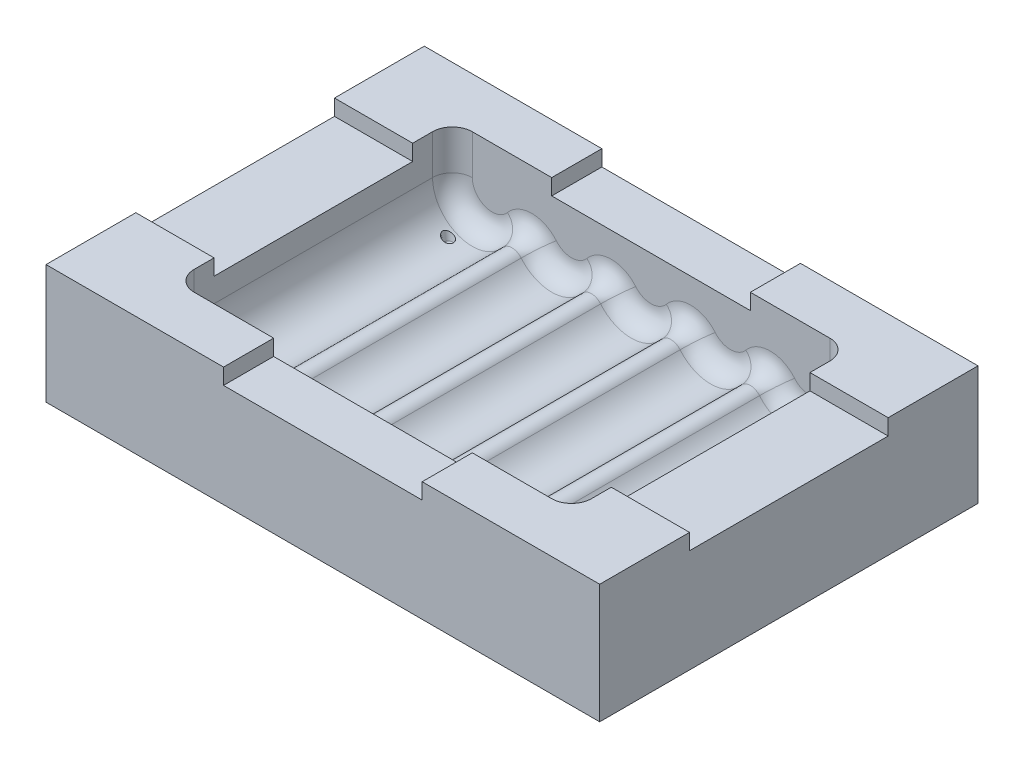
ISO-10303-21;
HEADER;
FILE_DESCRIPTION(('STEP AP214'),'2;1');
FILE_NAME('part.step','',(''),(''),'','','');
FILE_SCHEMA(('AUTOMOTIVE_DESIGN { 1 0 10303 214 1 1 1 1 }'));
ENDSEC;
DATA;
#1=APPLICATION_CONTEXT('core data for automotive mechanical design processes');
#2=APPLICATION_PROTOCOL_DEFINITION('international standard','automotive_design',2000,#1);
#3=PRODUCT_CONTEXT('',#1,'mechanical');
#4=PRODUCT('Part','Part','',(#3));
#5=PRODUCT_RELATED_PRODUCT_CATEGORY('part','',(#4));
#6=PRODUCT_DEFINITION_FORMATION('','',#4);
#7=PRODUCT_DEFINITION_CONTEXT('part definition',#1,'design');
#8=PRODUCT_DEFINITION('design','',#6,#7);
#9=PRODUCT_DEFINITION_SHAPE('','',#8);
#10=(LENGTH_UNIT() NAMED_UNIT(*) SI_UNIT(.MILLI.,.METRE.));
#11=(NAMED_UNIT(*) PLANE_ANGLE_UNIT() SI_UNIT($,.RADIAN.));
#12=(NAMED_UNIT(*) SI_UNIT($,.STERADIAN.) SOLID_ANGLE_UNIT());
#13=UNCERTAINTY_MEASURE_WITH_UNIT(LENGTH_MEASURE(1.E-05),#10,'distance_accuracy_value','');
#14=(GEOMETRIC_REPRESENTATION_CONTEXT(3) GLOBAL_UNCERTAINTY_ASSIGNED_CONTEXT((#13)) GLOBAL_UNIT_ASSIGNED_CONTEXT((#10,
#11,#12)) REPRESENTATION_CONTEXT('',''));
#15=CARTESIAN_POINT('',(0.,0.,0.));
#16=DIRECTION('',(0.,0.,1.));
#17=DIRECTION('',(1.,0.,0.));
#18=AXIS2_PLACEMENT_3D('',#15,#16,#17);
#19=CARTESIAN_POINT('',(0.,-35.,0.));
#20=DIRECTION('',(0.,1.,0.));
#21=DIRECTION('',(0.,0.,1.));
#22=AXIS2_PLACEMENT_3D('',#19,#20,#21);
#23=PLANE('',#22);
#24=DIRECTION('',(0.,0.,1.));
#25=VECTOR('',#24,1.);
#26=CARTESIAN_POINT('',(34.8431512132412,-35.,-23.8064462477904));
#27=LINE('',#26,#25);
#28=CARTESIAN_POINT('',(34.8431512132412,-35.,-23.8064462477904));
#29=VERTEX_POINT('',#28);
#30=CARTESIAN_POINT('',(34.8431512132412,-35.,23.8064462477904));
#31=VERTEX_POINT('',#30);
#32=EDGE_CURVE('E477',#29,#31,#27,.T.);
#33=ORIENTED_EDGE('',*,*,#32,.T.);
#34=DIRECTION('',(-1.,0.,0.));
#35=VECTOR('',#34,1.);
#36=CARTESIAN_POINT('',(-34.8431512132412,-35.,23.8064462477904));
#37=LINE('',#36,#35);
#38=CARTESIAN_POINT('',(-34.8431512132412,-35.,23.8064462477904));
#39=VERTEX_POINT('',#38);
#40=EDGE_CURVE('E480',#31,#39,#37,.T.);
#41=ORIENTED_EDGE('',*,*,#40,.T.);
#42=DIRECTION('',(0.,0.,-1.));
#43=VECTOR('',#42,1.);
#44=CARTESIAN_POINT('',(-34.8431512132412,-35.,-23.8064462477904));
#45=LINE('',#44,#43);
#46=CARTESIAN_POINT('',(-34.8431512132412,-35.,-23.8064462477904));
#47=VERTEX_POINT('',#46);
#48=EDGE_CURVE('E483',#39,#47,#45,.T.);
#49=ORIENTED_EDGE('',*,*,#48,.T.);
#50=DIRECTION('',(1.,0.,0.));
#51=VECTOR('',#50,1.);
#52=CARTESIAN_POINT('',(-34.8431512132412,-35.,-23.8064462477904));
#53=LINE('',#52,#51);
#54=EDGE_CURVE('E486',#47,#29,#53,.T.);
#55=ORIENTED_EDGE('',*,*,#54,.T.);
#56=EDGE_LOOP('',(#33,#41,#49,#55));
#57=FACE_BOUND('',#56,.T.);
#58=ADVANCED_FACE('F36',(#57),#23,.F.);
#59=CARTESIAN_POINT('',(-34.8431512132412,-15.,23.8064462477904));
#60=DIRECTION('',(0.,0.,1.));
#61=DIRECTION('',(1.,0.,0.));
#62=AXIS2_PLACEMENT_3D('',#59,#60,#61);
#63=PLANE('',#62);
#64=DIRECTION('',(1.,0.,0.));
#65=VECTOR('',#64,1.);
#66=CARTESIAN_POINT('',(-34.8431512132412,-20.,23.8064462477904));
#67=LINE('',#66,#65);
#68=CARTESIAN_POINT('',(-34.8431512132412,-20.,23.8064462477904));
#69=VERTEX_POINT('',#68);
#70=CARTESIAN_POINT('',(-12.5,-20.,23.8064462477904));
#71=VERTEX_POINT('',#70);
#72=EDGE_CURVE('E468',#69,#71,#67,.T.);
#73=ORIENTED_EDGE('',*,*,#72,.F.);
#74=DIRECTION('',(0.,-1.,0.));
#75=VECTOR('',#74,1.);
#76=CARTESIAN_POINT('',(-34.8431512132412,-15.,23.8064462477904));
#77=LINE('',#76,#75);
#78=EDGE_CURVE('E497',#69,#39,#77,.T.);
#79=ORIENTED_EDGE('',*,*,#78,.T.);
#80=ORIENTED_EDGE('',*,*,#40,.F.);
#81=DIRECTION('',(0.,-1.,0.));
#82=VECTOR('',#81,1.);
#83=CARTESIAN_POINT('',(34.8431512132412,-15.,23.8064462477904));
#84=LINE('',#83,#82);
#85=CARTESIAN_POINT('',(34.8431512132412,-20.,23.8064462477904));
#86=VERTEX_POINT('',#85);
#87=EDGE_CURVE('E489',#86,#31,#84,.T.);
#88=ORIENTED_EDGE('',*,*,#87,.F.);
#89=DIRECTION('',(-1.,0.,0.));
#90=VECTOR('',#89,1.);
#91=CARTESIAN_POINT('',(-34.8431512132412,-20.,23.8064462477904));
#92=LINE('',#91,#90);
#93=CARTESIAN_POINT('',(12.5,-20.,23.8064462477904));
#94=VERTEX_POINT('',#93);
#95=EDGE_CURVE('E493',#86,#94,#92,.T.);
#96=ORIENTED_EDGE('',*,*,#95,.T.);
#97=DIRECTION('',(0.,1.,0.));
#98=VECTOR('',#97,1.);
#99=CARTESIAN_POINT('',(12.5,-15.,23.8064462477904));
#100=LINE('',#99,#98);
#101=CARTESIAN_POINT('',(12.5,-22.,23.8064462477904));
#102=VERTEX_POINT('',#101);
#103=EDGE_CURVE('E504',#102,#94,#100,.T.);
#104=ORIENTED_EDGE('',*,*,#103,.F.);
#105=DIRECTION('',(1.,0.,0.));
#106=VECTOR('',#105,1.);
#107=CARTESIAN_POINT('',(-34.8431512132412,-22.,23.8064462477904));
#108=LINE('',#107,#106);
#109=CARTESIAN_POINT('',(-12.5,-22.,23.8064462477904));
#110=VERTEX_POINT('',#109);
#111=EDGE_CURVE('E507',#110,#102,#108,.T.);
#112=ORIENTED_EDGE('',*,*,#111,.F.);
#113=DIRECTION('',(0.,-1.,0.));
#114=VECTOR('',#113,1.);
#115=CARTESIAN_POINT('',(-12.5,-15.,23.8064462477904));
#116=LINE('',#115,#114);
#117=EDGE_CURVE('E510',#71,#110,#116,.T.);
#118=ORIENTED_EDGE('',*,*,#117,.F.);
#119=EDGE_LOOP('',(#73,#79,#80,#88,#96,#104,#112,#118));
#120=FACE_BOUND('',#119,.T.);
#121=ADVANCED_FACE('F719',(#120),#63,.T.);
#122=CARTESIAN_POINT('',(-34.8431512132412,-15.,-23.8064462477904));
#123=DIRECTION('',(-1.,0.,0.));
#124=DIRECTION('',(0.,0.,1.));
#125=AXIS2_PLACEMENT_3D('',#122,#123,#124);
#126=PLANE('',#125);
#127=DIRECTION('',(0.,0.,1.));
#128=VECTOR('',#127,1.);
#129=CARTESIAN_POINT('',(-34.8431512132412,-20.,-23.8064462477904));
#130=LINE('',#129,#128);
#131=CARTESIAN_POINT('',(-34.8431512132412,-20.,12.5));
#132=VERTEX_POINT('',#131);
#133=EDGE_CURVE('E465',#132,#69,#130,.T.);
#134=ORIENTED_EDGE('',*,*,#133,.F.);
#135=DIRECTION('',(0.,-1.,0.));
#136=VECTOR('',#135,1.);
#137=CARTESIAN_POINT('',(-34.8431512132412,-15.,12.5));
#138=LINE('',#137,#136);
#139=CARTESIAN_POINT('',(-34.8431512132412,-22.,12.5));
#140=VERTEX_POINT('',#139);
#141=EDGE_CURVE('E467',#132,#140,#138,.T.);
#142=ORIENTED_EDGE('',*,*,#141,.T.);
#143=DIRECTION('',(0.,0.,-1.));
#144=VECTOR('',#143,1.);
#145=CARTESIAN_POINT('',(-34.8431512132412,-22.,-23.8064462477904));
#146=LINE('',#145,#144);
#147=CARTESIAN_POINT('',(-34.8431512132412,-22.,-12.5));
#148=VERTEX_POINT('',#147);
#149=EDGE_CURVE('E519',#140,#148,#146,.T.);
#150=ORIENTED_EDGE('',*,*,#149,.T.);
#151=DIRECTION('',(0.,1.,0.));
#152=VECTOR('',#151,1.);
#153=CARTESIAN_POINT('',(-34.8431512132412,-15.,-12.5));
#154=LINE('',#153,#152);
#155=CARTESIAN_POINT('',(-34.8431512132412,-20.,-12.5));
#156=VERTEX_POINT('',#155);
#157=EDGE_CURVE('E516',#148,#156,#154,.T.);
#158=ORIENTED_EDGE('',*,*,#157,.T.);
#159=DIRECTION('',(0.,0.,-1.));
#160=VECTOR('',#159,1.);
#161=CARTESIAN_POINT('',(-34.8431512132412,-20.,-23.8064462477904));
#162=LINE('',#161,#160);
#163=CARTESIAN_POINT('',(-34.8431512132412,-20.,-23.8064462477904));
#164=VERTEX_POINT('',#163);
#165=EDGE_CURVE('E473',#156,#164,#162,.T.);
#166=ORIENTED_EDGE('',*,*,#165,.T.);
#167=DIRECTION('',(0.,-1.,0.));
#168=VECTOR('',#167,1.);
#169=CARTESIAN_POINT('',(-34.8431512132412,-15.,-23.8064462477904));
#170=LINE('',#169,#168);
#171=EDGE_CURVE('E494',#164,#47,#170,.T.);
#172=ORIENTED_EDGE('',*,*,#171,.T.);
#173=ORIENTED_EDGE('',*,*,#48,.F.);
#174=ORIENTED_EDGE('',*,*,#78,.F.);
#175=EDGE_LOOP('',(#134,#142,#150,#158,#166,#172,#173,#174));
#176=FACE_BOUND('',#175,.T.);
#177=ADVANCED_FACE('F579',(#176),#126,.T.);
#178=CARTESIAN_POINT('',(-34.8431512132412,-15.,-23.8064462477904));
#179=DIRECTION('',(0.,0.,-1.));
#180=DIRECTION('',(-1.,0.,0.));
#181=AXIS2_PLACEMENT_3D('',#178,#179,#180);
#182=PLANE('',#181);
#183=ORIENTED_EDGE('',*,*,#171,.F.);
#184=DIRECTION('',(1.,0.,0.));
#185=VECTOR('',#184,1.);
#186=CARTESIAN_POINT('',(-34.8431512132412,-20.,-23.8064462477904));
#187=LINE('',#186,#185);
#188=CARTESIAN_POINT('',(-12.5,-20.,-23.8064462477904));
#189=VERTEX_POINT('',#188);
#190=EDGE_CURVE('E469',#164,#189,#187,.T.);
#191=ORIENTED_EDGE('',*,*,#190,.T.);
#192=DIRECTION('',(0.,-1.,0.));
#193=VECTOR('',#192,1.);
#194=CARTESIAN_POINT('',(-12.5,-15.,-23.8064462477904));
#195=LINE('',#194,#193);
#196=CARTESIAN_POINT('',(-12.5,-22.,-23.8064462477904));
#197=VERTEX_POINT('',#196);
#198=EDGE_CURVE('E472',#189,#197,#195,.T.);
#199=ORIENTED_EDGE('',*,*,#198,.T.);
#200=DIRECTION('',(1.,0.,0.));
#201=VECTOR('',#200,1.);
#202=CARTESIAN_POINT('',(-34.8431512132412,-22.,-23.8064462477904));
#203=LINE('',#202,#201);
#204=CARTESIAN_POINT('',(12.5,-22.,-23.8064462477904));
#205=VERTEX_POINT('',#204);
#206=EDGE_CURVE('E528',#197,#205,#203,.T.);
#207=ORIENTED_EDGE('',*,*,#206,.T.);
#208=DIRECTION('',(0.,1.,0.));
#209=VECTOR('',#208,1.);
#210=CARTESIAN_POINT('',(12.5,-15.,-23.8064462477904));
#211=LINE('',#210,#209);
#212=CARTESIAN_POINT('',(12.5,-20.,-23.8064462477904));
#213=VERTEX_POINT('',#212);
#214=EDGE_CURVE('E525',#205,#213,#211,.T.);
#215=ORIENTED_EDGE('',*,*,#214,.T.);
#216=DIRECTION('',(-1.,0.,0.));
#217=VECTOR('',#216,1.);
#218=CARTESIAN_POINT('',(-34.8431512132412,-20.,-23.8064462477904));
#219=LINE('',#218,#217);
#220=CARTESIAN_POINT('',(34.8431512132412,-20.,-23.8064462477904));
#221=VERTEX_POINT('',#220);
#222=EDGE_CURVE('E476',#221,#213,#219,.T.);
#223=ORIENTED_EDGE('',*,*,#222,.F.);
#224=DIRECTION('',(0.,-1.,0.));
#225=VECTOR('',#224,1.);
#226=CARTESIAN_POINT('',(34.8431512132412,-15.,-23.8064462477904));
#227=LINE('',#226,#225);
#228=EDGE_CURVE('E490',#221,#29,#227,.T.);
#229=ORIENTED_EDGE('',*,*,#228,.T.);
#230=ORIENTED_EDGE('',*,*,#54,.F.);
#231=EDGE_LOOP('',(#183,#191,#199,#207,#215,#223,#229,#230));
#232=FACE_BOUND('',#231,.T.);
#233=ADVANCED_FACE('F721',(#232),#182,.T.);
#234=CARTESIAN_POINT('',(34.8431512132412,-15.,-23.8064462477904));
#235=DIRECTION('',(1.,0.,0.));
#236=DIRECTION('',(0.,0.,-1.));
#237=AXIS2_PLACEMENT_3D('',#234,#235,#236);
#238=PLANE('',#237);
#239=DIRECTION('',(0.,-1.,0.));
#240=VECTOR('',#239,1.);
#241=CARTESIAN_POINT('',(34.8431512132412,-15.,12.5));
#242=LINE('',#241,#240);
#243=CARTESIAN_POINT('',(34.8431512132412,-20.,12.5));
#244=VERTEX_POINT('',#243);
#245=CARTESIAN_POINT('',(34.8431512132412,-22.,12.5));
#246=VERTEX_POINT('',#245);
#247=EDGE_CURVE('E40',#244,#246,#242,.T.);
#248=ORIENTED_EDGE('',*,*,#247,.F.);
#249=DIRECTION('',(0.,0.,1.));
#250=VECTOR('',#249,1.);
#251=CARTESIAN_POINT('',(34.8431512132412,-20.,-23.8064462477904));
#252=LINE('',#251,#250);
#253=EDGE_CURVE('E463',#244,#86,#252,.T.);
#254=ORIENTED_EDGE('',*,*,#253,.T.);
#255=ORIENTED_EDGE('',*,*,#87,.T.);
#256=ORIENTED_EDGE('',*,*,#32,.F.);
#257=ORIENTED_EDGE('',*,*,#228,.F.);
#258=DIRECTION('',(0.,0.,-1.));
#259=VECTOR('',#258,1.);
#260=CARTESIAN_POINT('',(34.8431512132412,-20.,-23.8064462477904));
#261=LINE('',#260,#259);
#262=CARTESIAN_POINT('',(34.8431512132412,-20.,-12.5));
#263=VERTEX_POINT('',#262);
#264=EDGE_CURVE('E474',#263,#221,#261,.T.);
#265=ORIENTED_EDGE('',*,*,#264,.F.);
#266=DIRECTION('',(0.,1.,0.));
#267=VECTOR('',#266,1.);
#268=CARTESIAN_POINT('',(34.8431512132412,-15.,-12.5));
#269=LINE('',#268,#267);
#270=CARTESIAN_POINT('',(34.8431512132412,-22.,-12.5));
#271=VERTEX_POINT('',#270);
#272=EDGE_CURVE('E309',#271,#263,#269,.T.);
#273=ORIENTED_EDGE('',*,*,#272,.F.);
#274=DIRECTION('',(0.,0.,-1.));
#275=VECTOR('',#274,1.);
#276=CARTESIAN_POINT('',(34.8431512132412,-22.,-23.8064462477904));
#277=LINE('',#276,#275);
#278=EDGE_CURVE('E532',#246,#271,#277,.T.);
#279=ORIENTED_EDGE('',*,*,#278,.F.);
#280=EDGE_LOOP('',(#248,#254,#255,#256,#257,#265,#273,#279));
#281=FACE_BOUND('',#280,.T.);
#282=ADVANCED_FACE('F38',(#281),#238,.T.);
#283=CARTESIAN_POINT('',(-22.,-30.5,-14.));
#284=DIRECTION('',(0.,1.,0.));
#285=DIRECTION('',(0.,0.,1.));
#286=AXIS2_PLACEMENT_3D('',#283,#284,#285);
#287=PLANE('',#286);
#288=CARTESIAN_POINT('',(-22.,-30.5,-14.));
#289=DIRECTION('',(0.,1.,0.));
#290=DIRECTION('',(0.,0.,1.));
#291=AXIS2_PLACEMENT_3D('',#288,#289,#290);
#292=CIRCLE('',#291,0.290225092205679);
#293=CARTESIAN_POINT('',(-22.,-30.5,-13.7097749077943));
#294=VERTEX_POINT('',#293);
#295=EDGE_CURVE('E539',#294,#294,#292,.F.);
#296=ORIENTED_EDGE('',*,*,#295,.F.);
#297=EDGE_LOOP('',(#296));
#298=FACE_BOUND('',#297,.T.);
#299=ADVANCED_FACE('F662',(#298),#287,.T.);
#300=CARTESIAN_POINT('',(-22.,-30.25,-14.));
#301=DIRECTION('',(0.,1.,0.));
#302=DIRECTION('',(0.,0.,1.));
#303=AXIS2_PLACEMENT_3D('',#300,#301,#302);
#304=TOROIDAL_SURFACE('',#303,0.290225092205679,0.25);
#305=ORIENTED_EDGE('',*,*,#295,.T.);
#306=EDGE_LOOP('',(#305));
#307=FACE_BOUND('',#306,.T.);
#308=CARTESIAN_POINT('',(-22.,-30.2934120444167,-14.));
#309=DIRECTION('',(0.,-1.,0.));
#310=DIRECTION('',(0.,0.,-1.));
#311=AXIS2_PLACEMENT_3D('',#308,#309,#310);
#312=CIRCLE('',#311,0.536427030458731);
#313=CARTESIAN_POINT('',(-22.,-30.2934120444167,-14.5364270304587));
#314=VERTEX_POINT('',#313);
#315=EDGE_CURVE('E543',#314,#314,#312,.F.);
#316=ORIENTED_EDGE('',*,*,#315,.T.);
#317=EDGE_LOOP('',(#316));
#318=FACE_BOUND('',#317,.T.);
#319=ADVANCED_FACE('F658',(#307,#318),#304,.F.);
#320=CARTESIAN_POINT('',(-22.,-30.5,-14.));
#321=DIRECTION('',(0.,1.,0.));
#322=DIRECTION('',(0.,0.,1.));
#323=AXIS2_PLACEMENT_3D('',#320,#321,#322);
#324=CONICAL_SURFACE('',#323,0.499999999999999,0.174532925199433);
#325=ORIENTED_EDGE('',*,*,#315,.F.);
#326=EDGE_LOOP('',(#325));
#327=FACE_BOUND('',#326,.T.);
#328=CARTESIAN_POINT('',(-22.522981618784,-29.3167770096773,-14.4781762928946));
#329=CARTESIAN_POINT('',(-22.4885081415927,-29.3369241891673,-14.5106134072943));
#330=CARTESIAN_POINT('',(-22.4509534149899,-29.3583124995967,-14.539102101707));
#331=CARTESIAN_POINT('',(-22.3712514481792,-29.4021863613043,-14.5876995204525));
#332=CARTESIAN_POINT('',(-22.3290921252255,-29.4246747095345,-14.6077854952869));
#333=CARTESIAN_POINT('',(-22.2462877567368,-29.4672275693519,-14.6374307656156));
#334=CARTESIAN_POINT('',(-22.2059625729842,-29.4872942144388,-14.6478857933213));
#335=CARTESIAN_POINT('',(-22.1238118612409,-29.5267533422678,-14.6613990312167));
#336=CARTESIAN_POINT('',(-22.0819879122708,-29.5461464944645,-14.6644648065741));
#337=CARTESIAN_POINT('',(-21.9968118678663,-29.5842091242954,-14.6628673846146));
#338=CARTESIAN_POINT('',(-21.9534485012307,-29.6028461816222,-14.6579989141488));
#339=CARTESIAN_POINT('',(-21.8677136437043,-29.6382965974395,-14.6398716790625));
#340=CARTESIAN_POINT('',(-21.8253420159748,-29.6551102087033,-14.6266140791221));
#341=CARTESIAN_POINT('',(-21.7462442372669,-29.6853277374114,-14.5929566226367));
#342=CARTESIAN_POINT('',(-21.7093312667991,-29.6988899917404,-14.5731397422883));
#343=CARTESIAN_POINT('',(-21.6393202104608,-29.7237706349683,-14.5265670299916));
#344=CARTESIAN_POINT('',(-21.6062195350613,-29.7350905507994,-14.4998159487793));
#345=CARTESIAN_POINT('',(-21.5481851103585,-29.7543635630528,-14.4428537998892));
#346=CARTESIAN_POINT('',(-21.5227777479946,-29.7625321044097,-14.4131974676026));
#347=CARTESIAN_POINT('',(-21.4773920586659,-29.7768065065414,-14.3495486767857));
#348=CARTESIAN_POINT('',(-21.4574113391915,-29.7829132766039,-14.315558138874));
#349=CARTESIAN_POINT('',(-21.4249064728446,-29.7926935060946,-14.2467517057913));
#350=CARTESIAN_POINT('',(-21.4119652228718,-29.7965050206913,-14.2121519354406));
#351=CARTESIAN_POINT('',(-21.3920572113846,-29.8023208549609,-14.1411302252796));
#352=CARTESIAN_POINT('',(-21.3850890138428,-29.8043256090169,-14.104708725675));
#353=CARTESIAN_POINT('',(-21.3775411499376,-29.8064950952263,-14.0324683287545));
#354=CARTESIAN_POINT('',(-21.3767436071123,-29.8067225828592,-13.9966738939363));
#355=CARTESIAN_POINT('',(-21.380992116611,-29.8055036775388,-13.9254645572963));
#356=CARTESIAN_POINT('',(-21.3860376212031,-29.8040574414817,-13.8900496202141));
#357=CARTESIAN_POINT('',(-21.4017142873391,-29.7995064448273,-13.820913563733));
#358=CARTESIAN_POINT('',(-21.4122972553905,-29.7964159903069,-13.7871805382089));
#359=CARTESIAN_POINT('',(-21.4386333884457,-29.7885824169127,-13.722006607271));
#360=CARTESIAN_POINT('',(-21.4543866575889,-29.7838392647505,-13.6905657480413));
#361=CARTESIAN_POINT('',(-21.490774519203,-29.772625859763,-13.6303383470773));
#362=CARTESIAN_POINT('',(-21.511478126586,-29.7661310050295,-13.6015981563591));
#363=CARTESIAN_POINT('',(-21.5569131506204,-29.7514829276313,-13.5479922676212));
#364=CARTESIAN_POINT('',(-21.5816450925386,-29.7433294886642,-13.523127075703));
#365=CARTESIAN_POINT('',(-21.6353767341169,-29.7250796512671,-13.4768721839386));
#366=CARTESIAN_POINT('',(-21.6645069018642,-29.7149189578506,-13.4556596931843));
#367=CARTESIAN_POINT('',(-21.7253087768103,-29.6930111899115,-13.4183157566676));
#368=CARTESIAN_POINT('',(-21.7569811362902,-29.6812637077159,-13.4021856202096));
#369=CARTESIAN_POINT('',(-21.8241236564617,-29.655528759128,-13.3742640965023));
#370=CARTESIAN_POINT('',(-21.8597062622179,-29.6414442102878,-13.3628332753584));
#371=CARTESIAN_POINT('',(-21.9317171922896,-29.611939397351,-13.3459285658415));
#372=CARTESIAN_POINT('',(-21.9681458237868,-29.5965186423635,-13.3404568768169));
#373=CARTESIAN_POINT('',(-22.0441237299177,-29.5632687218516,-13.3351170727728));
#374=CARTESIAN_POINT('',(-22.0836694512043,-29.5453466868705,-13.3357764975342));
#375=CARTESIAN_POINT('',(-22.1617322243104,-29.5087443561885,-13.34371629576));
#376=CARTESIAN_POINT('',(-22.2002488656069,-29.4900637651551,-13.3509992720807));
#377=CARTESIAN_POINT('',(-22.2783432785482,-29.4509777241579,-13.3727311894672));
#378=CARTESIAN_POINT('',(-22.3177679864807,-29.4305517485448,-13.3876965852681));
#379=CARTESIAN_POINT('',(-22.3934424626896,-29.390133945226,-13.4247056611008));
#380=CARTESIAN_POINT('',(-22.4296897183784,-29.3701424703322,-13.4467548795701));
#381=CARTESIAN_POINT('',(-22.4983303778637,-29.3312722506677,-13.4979468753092));
#382=CARTESIAN_POINT('',(-22.5306722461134,-29.3124097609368,-13.5271716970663));
#383=CARTESIAN_POINT('',(-22.5896428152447,-29.2772569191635,-13.592181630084));
#384=CARTESIAN_POINT('',(-22.6162828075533,-29.2609615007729,-13.6279535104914));
#385=CARTESIAN_POINT('',(-22.655740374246,-29.2364397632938,-13.6942595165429));
#386=CARTESIAN_POINT('',(-22.6703336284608,-29.2272372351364,-13.7233822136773));
#387=CARTESIAN_POINT('',(-22.6951860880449,-29.2114355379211,-13.7840847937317));
#388=CARTESIAN_POINT('',(-22.705449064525,-29.2048341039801,-13.8156625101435));
#389=CARTESIAN_POINT('',(-22.7211211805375,-29.1947096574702,-13.8806783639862));
#390=CARTESIAN_POINT('',(-22.7265036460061,-29.1912035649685,-13.9141256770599));
#391=CARTESIAN_POINT('',(-22.7319540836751,-29.1876531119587,-13.9816323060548));
#392=CARTESIAN_POINT('',(-22.7320239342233,-29.1876075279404,-14.0156914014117));
#393=CARTESIAN_POINT('',(-22.7270869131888,-29.1908236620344,-14.080169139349));
#394=CARTESIAN_POINT('',(-22.7225364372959,-29.1937880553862,-14.1106395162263));
#395=CARTESIAN_POINT('',(-22.709296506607,-29.2023533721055,-14.1702809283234));
#396=CARTESIAN_POINT('',(-22.7006057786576,-29.2079551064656,-14.1994515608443));
#397=CARTESIAN_POINT('',(-22.6792036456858,-29.2216149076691,-14.2566428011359));
#398=CARTESIAN_POINT('',(-22.6663848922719,-29.2297383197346,-14.2846070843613));
#399=CARTESIAN_POINT('',(-22.6373390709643,-29.247909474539,-14.3379936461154));
#400=CARTESIAN_POINT('',(-22.6211134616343,-29.2579563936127,-14.3634170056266));
#401=CARTESIAN_POINT('',(-22.591302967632,-29.2761374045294,-14.4039163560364));
#402=CARTESIAN_POINT('',(-22.5784817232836,-29.2838855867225,-14.4197399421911));
#403=CARTESIAN_POINT('',(-22.5516183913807,-29.299940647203,-14.4500038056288));
#404=CARTESIAN_POINT('',(-22.5375761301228,-29.3082476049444,-14.4644438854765));
#405=CARTESIAN_POINT('',(-22.522981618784,-29.3167770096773,-14.4781762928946));
#406=B_SPLINE_CURVE_WITH_KNOTS('',3,(#328,#329,#330,#331,#332,#333,#334,#335,#336,#337,#338,
#339,#340,#341,#342,#343,#344,#345,#346,#347,#348,#349,#350,#351,#352,#353,#354,#355,#356,#357,
#358,#359,#360,#361,#362,#363,#364,#365,#366,#367,#368,#369,#370,#371,#372,#373,#374,#375,#376,
#377,#378,#379,#380,#381,#382,#383,#384,#385,#386,#387,#388,#389,#390,#391,#392,#393,#394,#395,
#396,#397,#398,#399,#400,#401,#402,#403,#404,#405),.UNSPECIFIED.,.T.,.F.,(4,2,2,2,2,2,2,2,2,2,2,
2,2,2,2,2,2,2,2,2,2,2,2,2,2,2,2,2,2,2,2,2,2,2,2,2,2,2,4),(0.,0.154232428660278,
0.308879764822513,0.446996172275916,0.58497111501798,0.726572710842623,0.868154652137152,
0.999542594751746,1.13084075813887,1.24990351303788,1.36891368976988,1.47976959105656,
1.59059883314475,1.69749617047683,1.80438348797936,1.91035565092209,2.01632994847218,
2.12387799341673,2.23144007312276,2.34327320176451,2.45513511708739,2.57444805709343,
2.69380501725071,2.82352078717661,2.95328755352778,3.09321529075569,3.23325269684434,
3.37497261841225,3.51640924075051,3.61754933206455,3.71860116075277,3.82020200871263,
3.92176693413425,4.01418988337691,4.10664127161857,4.20172275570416,4.29676361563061,
4.36204934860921,4.42734438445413),.UNSPECIFIED.);
#407=CARTESIAN_POINT('',(-22.522981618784,-29.3167770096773,-14.4781762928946));
#408=VERTEX_POINT('',#407);
#409=EDGE_CURVE('E548',#408,#408,#406,.T.);
#410=ORIENTED_EDGE('',*,*,#409,.F.);
#411=EDGE_LOOP('',(#410));
#412=FACE_BOUND('',#411,.T.);
#413=ADVANCED_FACE('F653',(#327,#412),#324,.F.);
#414=CARTESIAN_POINT('',(-22.,-30.5,14.));
#415=DIRECTION('',(0.,1.,0.));
#416=DIRECTION('',(0.,0.,1.));
#417=AXIS2_PLACEMENT_3D('',#414,#415,#416);
#418=PLANE('',#417);
#419=CARTESIAN_POINT('',(-22.,-30.5,14.));
#420=DIRECTION('',(0.,1.,0.));
#421=DIRECTION('',(0.,0.,1.));
#422=AXIS2_PLACEMENT_3D('',#419,#420,#421);
#423=CIRCLE('',#422,0.290225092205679);
#424=CARTESIAN_POINT('',(-22.,-30.5,14.2902250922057));
#425=VERTEX_POINT('',#424);
#426=EDGE_CURVE('E874',#425,#425,#423,.F.);
#427=ORIENTED_EDGE('',*,*,#426,.F.);
#428=EDGE_LOOP('',(#427));
#429=FACE_BOUND('',#428,.T.);
#430=ADVANCED_FACE('F650',(#429),#418,.T.);
#431=CARTESIAN_POINT('',(-22.,-30.25,14.));
#432=DIRECTION('',(0.,1.,0.));
#433=DIRECTION('',(0.,0.,1.));
#434=AXIS2_PLACEMENT_3D('',#431,#432,#433);
#435=TOROIDAL_SURFACE('',#434,0.290225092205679,0.25);
#436=ORIENTED_EDGE('',*,*,#426,.T.);
#437=EDGE_LOOP('',(#436));
#438=FACE_BOUND('',#437,.T.);
#439=CARTESIAN_POINT('',(-22.,-30.2934120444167,14.));
#440=DIRECTION('',(0.,-1.,0.));
#441=DIRECTION('',(0.,0.,-1.));
#442=AXIS2_PLACEMENT_3D('',#439,#440,#441);
#443=CIRCLE('',#442,0.536427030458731);
#444=CARTESIAN_POINT('',(-22.,-30.2934120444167,13.4635729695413));
#445=VERTEX_POINT('',#444);
#446=EDGE_CURVE('E629',#445,#445,#443,.F.);
#447=ORIENTED_EDGE('',*,*,#446,.T.);
#448=EDGE_LOOP('',(#447));
#449=FACE_BOUND('',#448,.T.);
#450=ADVANCED_FACE('F645',(#438,#449),#435,.F.);
#451=CARTESIAN_POINT('',(-22.,-30.5,14.));
#452=DIRECTION('',(0.,1.,0.));
#453=DIRECTION('',(0.,0.,1.));
#454=AXIS2_PLACEMENT_3D('',#451,#452,#453);
#455=CONICAL_SURFACE('',#454,0.499999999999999,0.174532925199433);
#456=ORIENTED_EDGE('',*,*,#446,.F.);
#457=EDGE_LOOP('',(#456));
#458=FACE_BOUND('',#457,.T.);
#459=CARTESIAN_POINT('',(-22.5245249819,-29.3158746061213,13.5232805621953));
#460=CARTESIAN_POINT('',(-22.4901331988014,-29.3359905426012,13.4907156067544));
#461=CARTESIAN_POINT('',(-22.4526455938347,-29.3573598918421,13.4620971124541));
#462=CARTESIAN_POINT('',(-22.3730543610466,-29.4012141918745,13.4132388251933));
#463=CARTESIAN_POINT('',(-22.3309385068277,-29.4237020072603,13.3930219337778));
#464=CARTESIAN_POINT('',(-22.2482383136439,-29.4662455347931,13.3631429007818));
#465=CARTESIAN_POINT('',(-22.2079786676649,-29.4863019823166,13.3525775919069));
#466=CARTESIAN_POINT('',(-22.125944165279,-29.5257517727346,13.3388266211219));
#467=CARTESIAN_POINT('',(-22.0841709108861,-29.545145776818,13.3356333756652));
#468=CARTESIAN_POINT('',(-21.9990285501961,-29.583243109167,13.3369554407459));
#469=CARTESIAN_POINT('',(-21.9556470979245,-29.6019129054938,13.3416845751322));
#470=CARTESIAN_POINT('',(-21.8698501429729,-29.637436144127,13.3595357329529));
#471=CARTESIAN_POINT('',(-21.827434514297,-29.6542898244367,13.3726566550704));
#472=CARTESIAN_POINT('',(-21.7482056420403,-29.6845969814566,13.4060666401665));
#473=CARTESIAN_POINT('',(-21.7112086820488,-29.6982074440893,13.4257758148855));
#474=CARTESIAN_POINT('',(-21.6410101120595,-29.7231846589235,13.472152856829));
#475=CARTESIAN_POINT('',(-21.6078059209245,-29.7345529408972,13.4988159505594));
#476=CARTESIAN_POINT('',(-21.5495619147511,-29.7539156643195,13.5556318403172));
#477=CARTESIAN_POINT('',(-21.5240494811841,-29.7621258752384,13.5852272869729));
#478=CARTESIAN_POINT('',(-21.4784451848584,-29.7764812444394,13.6487768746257));
#479=CARTESIAN_POINT('',(-21.4583509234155,-29.7826273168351,13.6827290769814));
#480=CARTESIAN_POINT('',(-21.4256288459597,-29.7924790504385,13.7514745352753));
#481=CARTESIAN_POINT('',(-21.412582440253,-29.7963235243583,13.7860492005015));
#482=CARTESIAN_POINT('',(-21.3924626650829,-29.8022035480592,13.8570406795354));
#483=CARTESIAN_POINT('',(-21.3853878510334,-29.804239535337,13.8934570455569));
#484=CARTESIAN_POINT('',(-21.3776345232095,-29.8064684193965,13.9656971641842));
#485=CARTESIAN_POINT('',(-21.3767364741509,-29.8067245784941,14.0014955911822));
#486=CARTESIAN_POINT('',(-21.3807874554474,-29.8055624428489,14.0727303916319));
#487=CARTESIAN_POINT('',(-21.3857359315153,-29.8041443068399,14.108166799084));
#488=CARTESIAN_POINT('',(-21.4012247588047,-29.7996492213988,14.1773545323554));
#489=CARTESIAN_POINT('',(-21.4117157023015,-29.7965869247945,14.2111179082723));
#490=CARTESIAN_POINT('',(-21.437875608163,-29.7888097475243,14.2763674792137));
#491=CARTESIAN_POINT('',(-21.4535446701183,-29.7840948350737,14.3078536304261));
#492=CARTESIAN_POINT('',(-21.4897698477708,-29.7729392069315,14.3681791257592));
#493=CARTESIAN_POINT('',(-21.5103941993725,-29.7664742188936,14.3969729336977));
#494=CARTESIAN_POINT('',(-21.555682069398,-29.7518857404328,14.4506979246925));
#495=CARTESIAN_POINT('',(-21.5803461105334,-29.7437620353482,14.4756286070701));
#496=CARTESIAN_POINT('',(-21.633946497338,-29.7255739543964,14.5220211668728));
#497=CARTESIAN_POINT('',(-21.6630130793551,-29.715445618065,14.5433072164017));
#498=CARTESIAN_POINT('',(-21.7237014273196,-29.6936013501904,14.5808069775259));
#499=CARTESIAN_POINT('',(-21.7553238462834,-29.6818850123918,14.5970193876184));
#500=CARTESIAN_POINT('',(-21.8223703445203,-29.6562148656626,14.6251140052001));
#501=CARTESIAN_POINT('',(-21.8579074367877,-29.6421641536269,14.6366372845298));
#502=CARTESIAN_POINT('',(-21.9298424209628,-29.61272379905,14.653733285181));
#503=CARTESIAN_POINT('',(-21.9662406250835,-29.5973336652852,14.659303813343));
#504=CARTESIAN_POINT('',(-22.0421669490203,-29.5641443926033,14.6648542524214));
#505=CARTESIAN_POINT('',(-22.0816928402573,-29.5462520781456,14.6643076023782));
#506=CARTESIAN_POINT('',(-22.1597328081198,-29.5097022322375,14.6565983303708));
#507=CARTESIAN_POINT('',(-22.1982464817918,-29.4910444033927,14.6494331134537));
#508=CARTESIAN_POINT('',(-22.2763629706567,-29.4519909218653,14.6279478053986));
#509=CARTESIAN_POINT('',(-22.3158135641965,-29.431573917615,14.6131097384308));
#510=CARTESIAN_POINT('',(-22.3915598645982,-29.3911600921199,14.5763572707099));
#511=CARTESIAN_POINT('',(-22.4278530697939,-29.3711636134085,14.5544373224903));
#512=CARTESIAN_POINT('',(-22.4966399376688,-29.3322477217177,14.5034847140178));
#513=CARTESIAN_POINT('',(-22.5290786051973,-29.3133455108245,14.4743640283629));
#514=CARTESIAN_POINT('',(-22.5882628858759,-29.2780930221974,14.4095489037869));
#515=CARTESIAN_POINT('',(-22.6150196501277,-29.2617377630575,14.3738676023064));
#516=CARTESIAN_POINT('',(-22.6547147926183,-29.2370830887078,14.307667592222));
#517=CARTESIAN_POINT('',(-22.6694193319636,-29.2278151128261,14.2785624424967));
#518=CARTESIAN_POINT('',(-22.6944946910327,-29.2118783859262,14.217873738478));
#519=CARTESIAN_POINT('',(-22.7048692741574,-29.2052073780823,14.1862923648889));
#520=CARTESIAN_POINT('',(-22.7207607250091,-29.1949437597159,14.1212433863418));
#521=CARTESIAN_POINT('',(-22.7262506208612,-29.1913682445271,14.0877663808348));
#522=CARTESIAN_POINT('',(-22.7319027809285,-29.1876866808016,14.0201770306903));
#523=CARTESIAN_POINT('',(-22.732066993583,-29.1875793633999,13.9860649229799));
#524=CARTESIAN_POINT('',(-22.7272938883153,-29.1906889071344,13.9215025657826));
#525=CARTESIAN_POINT('',(-22.722819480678,-29.1936041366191,13.8910015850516));
#526=CARTESIAN_POINT('',(-22.7097215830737,-29.2020791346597,13.831286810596));
#527=CARTESIAN_POINT('',(-22.7010968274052,-29.2076397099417,13.8020734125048));
#528=CARTESIAN_POINT('',(-22.6798306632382,-29.2212166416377,13.74482497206));
#529=CARTESIAN_POINT('',(-22.6670866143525,-29.229295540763,13.7168434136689));
#530=CARTESIAN_POINT('',(-22.6381865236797,-29.2473828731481,13.6634116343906));
#531=CARTESIAN_POINT('',(-22.6220319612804,-29.2573904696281,13.6379603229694));
#532=CARTESIAN_POINT('',(-22.5923770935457,-29.2754859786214,13.597460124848));
#533=CARTESIAN_POINT('',(-22.579645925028,-29.2831842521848,13.5816615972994));
#534=CARTESIAN_POINT('',(-22.5529682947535,-29.2991389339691,13.5514350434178));
#535=CARTESIAN_POINT('',(-22.5390216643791,-29.3073954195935,13.5370072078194));
#536=CARTESIAN_POINT('',(-22.5245249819,-29.3158746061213,13.5232805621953));
#537=B_SPLINE_CURVE_WITH_KNOTS('',3,(#459,#460,#461,#462,#463,#464,#465,#466,#467,#468,#469,
#470,#471,#472,#473,#474,#475,#476,#477,#478,#479,#480,#481,#482,#483,#484,#485,#486,#487,#488,
#489,#490,#491,#492,#493,#494,#495,#496,#497,#498,#499,#500,#501,#502,#503,#504,#505,#506,#507,
#508,#509,#510,#511,#512,#513,#514,#515,#516,#517,#518,#519,#520,#521,#522,#523,#524,#525,#526,
#527,#528,#529,#530,#531,#532,#533,#534,#535,#536),.UNSPECIFIED.,.T.,.F.,(4,2,2,2,2,2,2,2,2,2,2,
2,2,2,2,2,2,2,2,2,2,2,2,2,2,2,2,2,2,2,2,2,2,2,2,2,2,2,4),(0.,0.154274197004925,0.30896620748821,
0.44697486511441,0.58484149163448,0.726489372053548,0.868118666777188,0.999616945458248,
1.13102519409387,1.25017831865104,1.36927860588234,1.48018445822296,1.59106347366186,
1.69798026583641,1.80488692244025,1.91085626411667,2.01682764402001,2.1243515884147,
2.23188945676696,2.34367333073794,2.45548585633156,2.57472140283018,2.69400086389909,
2.82362151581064,2.95329300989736,3.09315386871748,3.23312455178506,3.37489912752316,
3.51639283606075,3.61768524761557,3.71888943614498,3.82064903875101,3.92237141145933,
4.01483642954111,4.1073296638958,4.20233267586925,4.29729456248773,4.36231455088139,
4.42734357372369),.UNSPECIFIED.);
#538=CARTESIAN_POINT('',(-22.5245249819,-29.3158746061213,13.5232805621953));
#539=VERTEX_POINT('',#538);
#540=EDGE_CURVE('E620',#539,#539,#537,.T.);
#541=ORIENTED_EDGE('',*,*,#540,.F.);
#542=EDGE_LOOP('',(#541));
#543=FACE_BOUND('',#542,.T.);
#544=ADVANCED_FACE('F639',(#458,#543),#455,.F.);
#545=CARTESIAN_POINT('',(22.,-30.5,-14.));
#546=DIRECTION('',(0.,1.,0.));
#547=DIRECTION('',(0.,0.,1.));
#548=AXIS2_PLACEMENT_3D('',#545,#546,#547);
#549=PLANE('',#548);
#550=CARTESIAN_POINT('',(22.,-30.5,-14.));
#551=DIRECTION('',(0.,1.,0.));
#552=DIRECTION('',(0.,0.,1.));
#553=AXIS2_PLACEMENT_3D('',#550,#551,#552);
#554=CIRCLE('',#553,0.290225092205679);
#555=CARTESIAN_POINT('',(22.,-30.5,-13.7097749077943));
#556=VERTEX_POINT('',#555);
#557=EDGE_CURVE('E628',#556,#556,#554,.F.);
#558=ORIENTED_EDGE('',*,*,#557,.F.);
#559=EDGE_LOOP('',(#558));
#560=FACE_BOUND('',#559,.T.);
#561=ADVANCED_FACE('F644',(#560),#549,.T.);
#562=CARTESIAN_POINT('',(22.,-30.25,-14.));
#563=DIRECTION('',(0.,1.,0.));
#564=DIRECTION('',(0.,0.,1.));
#565=AXIS2_PLACEMENT_3D('',#562,#563,#564);
#566=TOROIDAL_SURFACE('',#565,0.290225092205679,0.25);
#567=ORIENTED_EDGE('',*,*,#557,.T.);
#568=EDGE_LOOP('',(#567));
#569=FACE_BOUND('',#568,.T.);
#570=CARTESIAN_POINT('',(22.,-30.2934120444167,-14.));
#571=DIRECTION('',(0.,-1.,0.));
#572=DIRECTION('',(0.,0.,-1.));
#573=AXIS2_PLACEMENT_3D('',#570,#571,#572);
#574=CIRCLE('',#573,0.536427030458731);
#575=CARTESIAN_POINT('',(22.,-30.2934120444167,-14.5364270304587));
#576=VERTEX_POINT('',#575);
#577=EDGE_CURVE('E865',#576,#576,#574,.F.);
#578=ORIENTED_EDGE('',*,*,#577,.T.);
#579=EDGE_LOOP('',(#578));
#580=FACE_BOUND('',#579,.T.);
#581=ADVANCED_FACE('F852',(#569,#580),#566,.F.);
#582=CARTESIAN_POINT('',(22.,-30.5,-14.));
#583=DIRECTION('',(0.,1.,0.));
#584=DIRECTION('',(0.,0.,1.));
#585=AXIS2_PLACEMENT_3D('',#582,#583,#584);
#586=CONICAL_SURFACE('',#585,0.499999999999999,0.174532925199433);
#587=ORIENTED_EDGE('',*,*,#577,.F.);
#588=EDGE_LOOP('',(#587));
#589=FACE_BOUND('',#588,.T.);
#590=CARTESIAN_POINT('',(21.5706541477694,-29.7468985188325,-14.4648526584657));
#591=CARTESIAN_POINT('',(21.6023195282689,-29.7364203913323,-14.4966083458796));
#592=CARTESIAN_POINT('',(21.637012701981,-29.7245863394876,-14.5249810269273));
#593=CARTESIAN_POINT('',(21.7106613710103,-29.6984215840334,-14.574075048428));
#594=CARTESIAN_POINT('',(21.7496256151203,-29.6840857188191,-14.5947802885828));
#595=CARTESIAN_POINT('',(21.8241928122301,-29.6554998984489,-14.62574330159));
#596=CARTESIAN_POINT('',(21.8594657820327,-29.6415379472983,-14.6370795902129));
#597=CARTESIAN_POINT('',(21.9308149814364,-29.6123137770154,-14.6538898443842));
#598=CARTESIAN_POINT('',(21.9668905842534,-29.5970525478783,-14.6593682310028));
#599=CARTESIAN_POINT('',(22.0425088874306,-29.5639916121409,-14.6648605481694));
#600=CARTESIAN_POINT('',(22.0820488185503,-29.5460892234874,-14.6642935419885));
#601=CARTESIAN_POINT('',(22.1601230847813,-29.5095155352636,-14.6565384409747));
#602=CARTESIAN_POINT('',(22.1986567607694,-29.4908437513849,-14.649346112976));
#603=CARTESIAN_POINT('',(22.2767871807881,-29.4517739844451,-14.6278029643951));
#604=CARTESIAN_POINT('',(22.3162324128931,-29.431354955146,-14.6129375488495));
#605=CARTESIAN_POINT('',(22.3919624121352,-29.3909407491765,-14.5761305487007));
#606=CARTESIAN_POINT('',(22.4282447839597,-29.3709459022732,-14.5541836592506));
#607=CARTESIAN_POINT('',(22.4969997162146,-29.3320401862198,-14.5031808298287));
#608=CARTESIAN_POINT('',(22.5294178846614,-29.3131463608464,-14.4740379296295));
#609=CARTESIAN_POINT('',(22.5885568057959,-29.2779149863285,-14.409181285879));
#610=CARTESIAN_POINT('',(22.6152887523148,-29.2615724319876,-14.3734807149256));
#611=CARTESIAN_POINT('',(22.6549333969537,-29.2369459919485,-14.3072581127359));
#612=CARTESIAN_POINT('',(22.6696142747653,-29.2276919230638,-14.2781491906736));
#613=CARTESIAN_POINT('',(22.694642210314,-29.2117839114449,-14.2174575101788));
#614=CARTESIAN_POINT('',(22.7049930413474,-29.2051277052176,-14.1858769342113));
#615=CARTESIAN_POINT('',(22.7208376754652,-29.1948937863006,-14.1208356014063));
#616=CARTESIAN_POINT('',(22.7263046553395,-29.1913330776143,-14.0873655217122));
#617=CARTESIAN_POINT('',(22.7319141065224,-29.1876792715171,-14.0197937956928));
#618=CARTESIAN_POINT('',(22.7320583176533,-29.1875850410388,-13.9856923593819));
#619=CARTESIAN_POINT('',(22.7272500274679,-29.1907174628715,-13.9211443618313));
#620=CARTESIAN_POINT('',(22.7227587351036,-29.1936436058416,-13.8906469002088));
#621=CARTESIAN_POINT('',(22.7096300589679,-29.2021381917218,-13.8309482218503));
#622=CARTESIAN_POINT('',(22.700992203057,-29.2077069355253,-13.801747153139));
#623=CARTESIAN_POINT('',(22.6797019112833,-29.2212983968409,-13.7445247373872));
#624=CARTESIAN_POINT('',(22.6669470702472,-29.2293834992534,-13.7165567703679));
#625=CARTESIAN_POINT('',(22.6380217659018,-29.2474853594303,-13.663135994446));
#626=CARTESIAN_POINT('',(22.6218499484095,-29.2575028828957,-13.6376841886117));
#627=CARTESIAN_POINT('',(22.5841085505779,-29.2805299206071,-13.5861994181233));
#628=CARTESIAN_POINT('',(22.5620995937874,-29.2937621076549,-13.5605889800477));
#629=CARTESIAN_POINT('',(22.5149514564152,-29.3215470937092,-13.5132686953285));
#630=CARTESIAN_POINT('',(22.4898103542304,-29.3361007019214,-13.4915612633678));
#631=CARTESIAN_POINT('',(22.432501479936,-29.3685458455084,-13.4488891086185));
#632=CARTESIAN_POINT('',(22.3998637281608,-29.3865863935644,-13.4286669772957));
#633=CARTESIAN_POINT('',(22.3318747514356,-29.4231043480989,-13.3939891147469));
#634=CARTESIAN_POINT('',(22.2965219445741,-29.4415820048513,-13.3795367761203));
#635=CARTESIAN_POINT('',(22.219872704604,-29.4804244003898,-13.3553862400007));
#636=CARTESIAN_POINT('',(22.1783487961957,-29.5007748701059,-13.346379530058));
#637=CARTESIAN_POINT('',(22.093953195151,-29.5406539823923,-13.3361170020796));
#638=CARTESIAN_POINT('',(22.0510812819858,-29.5601824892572,-13.3348624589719));
#639=CARTESIAN_POINT('',(21.9651668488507,-29.5978604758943,-13.3404504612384));
#640=CARTESIAN_POINT('',(21.9221241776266,-29.6160080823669,-13.3473038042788));
#641=CARTESIAN_POINT('',(21.8374147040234,-29.6503756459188,-13.369346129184));
#642=CARTESIAN_POINT('',(21.7957472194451,-29.6665965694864,-13.3845309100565));
#643=CARTESIAN_POINT('',(21.718637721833,-29.6955137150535,-13.4216491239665));
#644=CARTESIAN_POINT('',(21.6829636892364,-29.7083863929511,-13.442961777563));
#645=CARTESIAN_POINT('',(21.6156975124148,-29.7318908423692,-13.4922363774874));
#646=CARTESIAN_POINT('',(21.5841028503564,-29.7425239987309,-13.5201941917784));
#647=CARTESIAN_POINT('',(21.5290933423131,-29.7605290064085,-13.5791567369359));
#648=CARTESIAN_POINT('',(21.5051937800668,-29.7681106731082,-13.6096459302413));
#649=CARTESIAN_POINT('',(21.4629366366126,-29.7812454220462,-13.6746391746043));
#650=CARTESIAN_POINT('',(21.4445767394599,-29.7867993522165,-13.7091415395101));
#651=CARTESIAN_POINT('',(21.4151717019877,-29.7955719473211,-13.7787568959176));
#652=CARTESIAN_POINT('',(21.4037317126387,-29.7989179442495,-13.8136875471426));
#653=CARTESIAN_POINT('',(21.3868424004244,-29.8038262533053,-13.8850867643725));
#654=CARTESIAN_POINT('',(21.3813915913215,-29.8053890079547,-13.9215549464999));
#655=CARTESIAN_POINT('',(21.3767695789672,-29.806715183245,-13.9937444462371));
#656=CARTESIAN_POINT('',(21.3774033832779,-29.8065344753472,-14.0294524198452));
#657=CARTESIAN_POINT('',(21.3844605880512,-29.8045064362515,-14.1002490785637));
#658=CARTESIAN_POINT('',(21.3908847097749,-29.8026588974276,-14.1353376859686));
#659=CARTESIAN_POINT('',(21.4092331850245,-29.7973067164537,-14.2037086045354));
#660=CARTESIAN_POINT('',(21.4211286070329,-29.793810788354,-14.2369994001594));
#661=CARTESIAN_POINT('',(21.4499714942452,-29.7851653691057,-14.3010502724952));
#662=CARTESIAN_POINT('',(21.4669138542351,-29.7800175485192,-14.3318128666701));
#663=CARTESIAN_POINT('',(21.4984418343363,-29.7702032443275,-14.3797219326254));
#664=CARTESIAN_POINT('',(21.5117371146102,-29.7660119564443,-14.3978322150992));
#665=CARTESIAN_POINT('',(21.5399912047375,-29.7569578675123,-14.4325234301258));
#666=CARTESIAN_POINT('',(21.5549503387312,-29.7520949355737,-14.4491040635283));
#667=CARTESIAN_POINT('',(21.5706541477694,-29.7468985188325,-14.4648526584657));
#668=B_SPLINE_CURVE_WITH_KNOTS('',3,(#590,#591,#592,#593,#594,#595,#596,#597,#598,#599,#600,
#601,#602,#603,#604,#605,#606,#607,#608,#609,#610,#611,#612,#613,#614,#615,#616,#617,#618,#619,
#620,#621,#622,#623,#624,#625,#626,#627,#628,#629,#630,#631,#632,#633,#634,#635,#636,#637,#638,
#639,#640,#641,#642,#643,#644,#645,#646,#647,#648,#649,#650,#651,#652,#653,#654,#655,#656,#657,
#658,#659,#660,#661,#662,#663,#664,#665,#666,#667),.UNSPECIFIED.,.T.,.F.,(4,2,2,2,2,2,2,2,2,2,2,
2,2,2,2,2,2,2,2,2,2,2,2,2,2,2,2,2,2,2,2,2,2,2,2,2,2,2,4),(0.,0.138044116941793,
0.276376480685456,0.39468297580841,0.512900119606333,0.64257234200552,0.772327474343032,
0.912203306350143,1.05218416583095,1.1939473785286,1.33542888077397,1.43668891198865,
1.53786051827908,1.6395844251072,1.74127508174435,1.83373991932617,1.92621528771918,
2.0211955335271,2.11621349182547,2.22460681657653,2.33306697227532,2.45981776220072,
2.58664297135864,2.7273174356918,2.86801503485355,3.00890021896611,3.14971442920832,
3.27951424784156,3.40923356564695,3.527041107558,3.64479932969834,3.75497573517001,
3.86512479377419,3.9717560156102,4.07840052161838,4.184487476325,4.29046748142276,
4.35891432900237,4.42737453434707),.UNSPECIFIED.);
#669=CARTESIAN_POINT('',(21.5706541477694,-29.7468985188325,-14.4648526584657));
#670=VERTEX_POINT('',#669);
#671=EDGE_CURVE('E825',#670,#670,#668,.T.);
#672=ORIENTED_EDGE('',*,*,#671,.F.);
#673=EDGE_LOOP('',(#672));
#674=FACE_BOUND('',#673,.T.);
#675=ADVANCED_FACE('F848',(#589,#674),#586,.F.);
#676=CARTESIAN_POINT('',(22.,-30.5,14.));
#677=DIRECTION('',(0.,1.,0.));
#678=DIRECTION('',(0.,0.,1.));
#679=AXIS2_PLACEMENT_3D('',#676,#677,#678);
#680=PLANE('',#679);
#681=CARTESIAN_POINT('',(22.,-30.5,14.));
#682=DIRECTION('',(0.,1.,0.));
#683=DIRECTION('',(0.,0.,1.));
#684=AXIS2_PLACEMENT_3D('',#681,#682,#683);
#685=CIRCLE('',#684,0.290225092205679);
#686=CARTESIAN_POINT('',(22.,-30.5,14.2902250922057));
#687=VERTEX_POINT('',#686);
#688=EDGE_CURVE('E868',#687,#687,#685,.F.);
#689=ORIENTED_EDGE('',*,*,#688,.F.);
#690=EDGE_LOOP('',(#689));
#691=FACE_BOUND('',#690,.T.);
#692=ADVANCED_FACE('F845',(#691),#680,.T.);
#693=CARTESIAN_POINT('',(22.,-30.25,14.));
#694=DIRECTION('',(0.,1.,0.));
#695=DIRECTION('',(0.,0.,1.));
#696=AXIS2_PLACEMENT_3D('',#693,#694,#695);
#697=TOROIDAL_SURFACE('',#696,0.290225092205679,0.25);
#698=ORIENTED_EDGE('',*,*,#688,.T.);
#699=EDGE_LOOP('',(#698));
#700=FACE_BOUND('',#699,.T.);
#701=CARTESIAN_POINT('',(22.,-30.2934120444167,14.));
#702=DIRECTION('',(0.,-1.,0.));
#703=DIRECTION('',(0.,0.,-1.));
#704=AXIS2_PLACEMENT_3D('',#701,#702,#703);
#705=CIRCLE('',#704,0.536427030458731);
#706=CARTESIAN_POINT('',(22.,-30.2934120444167,13.4635729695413));
#707=VERTEX_POINT('',#706);
#708=EDGE_CURVE('E824',#707,#707,#705,.F.);
#709=ORIENTED_EDGE('',*,*,#708,.T.);
#710=EDGE_LOOP('',(#709));
#711=FACE_BOUND('',#710,.T.);
#712=ADVANCED_FACE('F840',(#700,#711),#697,.F.);
#713=CARTESIAN_POINT('',(22.,-30.5,14.));
#714=DIRECTION('',(0.,1.,0.));
#715=DIRECTION('',(0.,0.,1.));
#716=AXIS2_PLACEMENT_3D('',#713,#714,#715);
#717=CONICAL_SURFACE('',#716,0.499999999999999,0.174532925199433);
#718=ORIENTED_EDGE('',*,*,#708,.F.);
#719=EDGE_LOOP('',(#718));
#720=FACE_BOUND('',#719,.T.);
#721=CARTESIAN_POINT('',(21.5669156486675,-29.7481338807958,13.5389271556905));
#722=CARTESIAN_POINT('',(21.5983361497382,-29.7377642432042,13.5069115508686));
#723=CARTESIAN_POINT('',(21.6328165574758,-29.7260365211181,13.478255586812));
#724=CARTESIAN_POINT('',(21.7061079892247,-29.7000752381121,13.428568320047));
#725=CARTESIAN_POINT('',(21.7449278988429,-29.6858364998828,13.4075530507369));
#726=CARTESIAN_POINT('',(21.8192350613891,-29.657438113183,13.3760284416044));
#727=CARTESIAN_POINT('',(21.8543807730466,-29.6435707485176,13.3644328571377));
#728=CARTESIAN_POINT('',(21.9255174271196,-29.6145267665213,13.347086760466));
#729=CARTESIAN_POINT('',(21.9615077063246,-29.5993511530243,13.3413318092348));
#730=CARTESIAN_POINT('',(22.0369790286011,-29.5664612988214,13.3352477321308));
#731=CARTESIAN_POINT('',(22.0764614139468,-29.5486434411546,13.3354964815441));
#732=CARTESIAN_POINT('',(22.1544682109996,-29.5122193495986,13.3426008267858));
#733=CARTESIAN_POINT('',(22.1929919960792,-29.4936126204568,13.3494606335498));
#734=CARTESIAN_POINT('',(22.2711808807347,-29.4546369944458,13.3703070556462));
#735=CARTESIAN_POINT('',(22.3106969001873,-29.4342447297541,13.3848124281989));
#736=CARTESIAN_POINT('',(22.386625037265,-29.3938449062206,13.4208935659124));
#737=CARTESIAN_POINT('',(22.4230347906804,-29.3738376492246,13.442474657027));
#738=CARTESIAN_POINT('',(22.4921974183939,-29.3348070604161,13.4927979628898));
#739=CARTESIAN_POINT('',(22.5248864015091,-29.3158032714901,13.5216438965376));
#740=CARTESIAN_POINT('',(22.5846242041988,-29.2802947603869,13.5859436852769));
#741=CARTESIAN_POINT('',(22.6116838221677,-29.2637852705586,13.6213846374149));
#742=CARTESIAN_POINT('',(22.6519992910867,-29.2387847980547,13.6873025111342));
#743=CARTESIAN_POINT('',(22.6669959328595,-29.2293454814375,13.7163610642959));
#744=CARTESIAN_POINT('',(22.6926563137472,-29.2130551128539,13.7770121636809));
#745=CARTESIAN_POINT('',(22.7033238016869,-29.2062018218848,13.8086024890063));
#746=CARTESIAN_POINT('',(22.7197908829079,-29.1955734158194,13.8737365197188));
#747=CARTESIAN_POINT('',(22.7255628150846,-29.1918157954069,13.9072901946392));
#748=CARTESIAN_POINT('',(22.7317449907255,-29.1877898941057,13.9750956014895));
#749=CARTESIAN_POINT('',(22.732157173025,-29.1875203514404,14.0093470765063));
#750=CARTESIAN_POINT('',(22.7278134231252,-29.1903505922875,14.0741353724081));
#751=CARTESIAN_POINT('',(22.7235371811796,-29.1931376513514,14.1047200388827));
#752=CARTESIAN_POINT('',(22.7108097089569,-29.2013768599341,14.1646275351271));
#753=CARTESIAN_POINT('',(22.7023580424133,-29.2068292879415,14.1939502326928));
#754=CARTESIAN_POINT('',(22.6814503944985,-29.2201871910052,14.2513349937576));
#755=CARTESIAN_POINT('',(22.6689054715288,-29.2281470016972,14.2793515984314));
#756=CARTESIAN_POINT('',(22.6403895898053,-29.2460128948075,14.3328997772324));
#757=CARTESIAN_POINT('',(22.624417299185,-29.2559197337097,14.3584303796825));
#758=CARTESIAN_POINT('',(22.5871224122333,-29.2787074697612,14.4100657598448));
#759=CARTESIAN_POINT('',(22.565364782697,-29.2918103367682,14.4357574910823));
#760=CARTESIAN_POINT('',(22.5187132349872,-29.3193539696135,14.4832802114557));
#761=CARTESIAN_POINT('',(22.4938173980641,-29.3337955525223,14.5051088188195));
#762=CARTESIAN_POINT('',(22.4370209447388,-29.3660238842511,14.5480941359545));
#763=CARTESIAN_POINT('',(22.4046476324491,-29.3839634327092,14.5685134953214));
#764=CARTESIAN_POINT('',(22.3371696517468,-29.4203064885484,14.603637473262));
#765=CARTESIAN_POINT('',(22.3020633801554,-29.4387102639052,14.6183387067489));
#766=CARTESIAN_POINT('',(22.2258222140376,-29.4774700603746,14.6431005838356));
#767=CARTESIAN_POINT('',(22.1844516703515,-29.4978148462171,14.6524606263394));
#768=CARTESIAN_POINT('',(22.1003107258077,-29.5377156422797,14.6634700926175));
#769=CARTESIAN_POINT('',(22.0575400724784,-29.5572715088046,14.6651181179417));
#770=CARTESIAN_POINT('',(21.9716472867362,-29.5950860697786,14.6603497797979));
#771=CARTESIAN_POINT('',(21.9285244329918,-29.6133392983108,14.6539013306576));
#772=CARTESIAN_POINT('',(21.8435786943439,-29.6479369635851,14.632653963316));
#773=CARTESIAN_POINT('',(21.8017551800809,-29.6642823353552,14.6178591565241));
#774=CARTESIAN_POINT('',(21.7242213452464,-29.6934684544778,14.5814370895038));
#775=CARTESIAN_POINT('',(21.6882882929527,-29.7064821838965,14.5604239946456));
#776=CARTESIAN_POINT('',(21.6204506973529,-29.7302675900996,14.5116878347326));
#777=CARTESIAN_POINT('',(21.588543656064,-29.7410406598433,14.4839689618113));
#778=CARTESIAN_POINT('',(21.5329106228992,-29.7593030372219,14.4254018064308));
#779=CARTESIAN_POINT('',(21.5087016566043,-29.7670034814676,14.395077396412));
#780=CARTESIAN_POINT('',(21.4658038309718,-29.7803687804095,14.3303482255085));
#781=CARTESIAN_POINT('',(21.4471126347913,-29.7860344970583,14.2959452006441));
#782=CARTESIAN_POINT('',(21.4170739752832,-29.7950111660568,14.2264858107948));
#783=CARTESIAN_POINT('',(21.4053269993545,-29.7984516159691,14.1916184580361));
#784=CARTESIAN_POINT('',(21.3878212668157,-29.8035441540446,14.1202882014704));
#785=CARTESIAN_POINT('',(21.3820609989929,-29.8051966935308,14.0838257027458));
#786=CARTESIAN_POINT('',(21.3768420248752,-29.8066945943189,14.011618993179));
#787=CARTESIAN_POINT('',(21.3771835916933,-29.8065972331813,13.9758902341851));
#788=CARTESIAN_POINT('',(21.3836679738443,-29.8047345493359,13.9050015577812));
#789=CARTESIAN_POINT('',(21.3898114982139,-29.8029690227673,13.8698417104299));
#790=CARTESIAN_POINT('',(21.407616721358,-29.7977807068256,13.8013029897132));
#791=CARTESIAN_POINT('',(21.41924609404,-29.7943676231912,13.7679149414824));
#792=CARTESIAN_POINT('',(21.4475813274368,-29.7858881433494,13.7036268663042));
#793=CARTESIAN_POINT('',(21.4642820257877,-29.7808234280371,13.6727243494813));
#794=CARTESIAN_POINT('',(21.4954265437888,-29.7711489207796,13.6245740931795));
#795=CARTESIAN_POINT('',(21.5085689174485,-29.7670152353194,13.6063716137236));
#796=CARTESIAN_POINT('',(21.5365287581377,-29.7580768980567,13.5714799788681));
#797=CARTESIAN_POINT('',(21.5513465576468,-29.7532721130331,13.5547911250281));
#798=CARTESIAN_POINT('',(21.5669156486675,-29.7481338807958,13.5389271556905));
#799=B_SPLINE_CURVE_WITH_KNOTS('',3,(#721,#722,#723,#724,#725,#726,#727,#728,#729,#730,#731,
#732,#733,#734,#735,#736,#737,#738,#739,#740,#741,#742,#743,#744,#745,#746,#747,#748,#749,#750,
#751,#752,#753,#754,#755,#756,#757,#758,#759,#760,#761,#762,#763,#764,#765,#766,#767,#768,#769,
#770,#771,#772,#773,#774,#775,#776,#777,#778,#779,#780,#781,#782,#783,#784,#785,#786,#787,#788,
#789,#790,#791,#792,#793,#794,#795,#796,#797,#798),.UNSPECIFIED.,.T.,.F.,(4,2,2,2,2,2,2,2,2,2,2,
2,2,2,2,2,2,2,2,2,2,2,2,2,2,2,2,2,2,2,2,2,2,2,2,2,2,2,4),(0.,0.138006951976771,
0.276301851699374,0.394394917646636,0.512398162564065,0.641801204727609,0.771286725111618,
0.910970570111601,1.05075979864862,1.19267072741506,1.334306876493,1.436003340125,
1.53761155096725,1.63979011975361,1.74193172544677,1.83452158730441,1.92712112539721,
2.02188411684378,2.11668399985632,2.22465496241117,2.33269226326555,2.45899260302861,
2.58536759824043,2.72583988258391,2.8663376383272,3.00739393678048,3.14838081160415,
3.27850631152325,3.40855067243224,3.52660956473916,3.6446183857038,3.75492922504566,
3.86521221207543,3.9718921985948,4.07858522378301,4.18465725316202,4.29062166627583,
4.35899154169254,4.42737500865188),.UNSPECIFIED.);
#800=CARTESIAN_POINT('',(21.5669156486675,-29.7481338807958,13.5389271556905));
#801=VERTEX_POINT('',#800);
#802=EDGE_CURVE('E815',#801,#801,#799,.T.);
#803=ORIENTED_EDGE('',*,*,#802,.F.);
#804=EDGE_LOOP('',(#803));
#805=FACE_BOUND('',#804,.T.);
#806=ADVANCED_FACE('F834',(#720,#805),#717,.F.);
#807=CARTESIAN_POINT('',(-20.,-25.,15.));
#808=DIRECTION('',(0.,0.,-1.));
#809=DIRECTION('',(-1.,0.,0.));
#810=AXIS2_PLACEMENT_3D('',#807,#808,#809);
#811=DEGENERATE_TOROIDAL_SURFACE('',#810,2.5,2.5,.T.);
#812=CARTESIAN_POINT('',(-18.0769230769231,-26.5974276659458,15.));
#813=DIRECTION('',(-0.638971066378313,-0.769230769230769,0.));
#814=DIRECTION('',(0.769230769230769,-0.638971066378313,0.));
#815=AXIS2_PLACEMENT_3D('',#812,#813,#814);
#816=CIRCLE('',#815,2.5);
#817=CARTESIAN_POINT('',(-16.1538461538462,-28.1948553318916,15.));
#818=VERTEX_POINT('',#817);
#819=CARTESIAN_POINT('',(-18.0769230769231,-26.5974276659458,17.5));
#820=VERTEX_POINT('',#819);
#821=EDGE_CURVE('E823',#818,#820,#816,.T.);
#822=ORIENTED_EDGE('',*,*,#821,.F.);
#823=CARTESIAN_POINT('',(-20.,-25.,15.));
#824=DIRECTION('',(0.,0.,-1.));
#825=DIRECTION('',(-1.,0.,0.));
#826=AXIS2_PLACEMENT_3D('',#823,#824,#825);
#827=CIRCLE('',#826,5.);
#828=CARTESIAN_POINT('',(-25.,-25.,15.));
#829=VERTEX_POINT('',#828);
#830=EDGE_CURVE('E616',#818,#829,#827,.T.);
#831=ORIENTED_EDGE('',*,*,#830,.T.);
#832=CARTESIAN_POINT('',(-22.5,-25.,15.));
#833=DIRECTION('',(0.,1.,0.));
#834=DIRECTION('',(0.,0.,1.));
#835=AXIS2_PLACEMENT_3D('',#832,#833,#834);
#836=CIRCLE('',#835,2.5);
#837=CARTESIAN_POINT('',(-22.5,-25.,17.5));
#838=VERTEX_POINT('',#837);
#839=EDGE_CURVE('E619',#829,#838,#836,.T.);
#840=ORIENTED_EDGE('',*,*,#839,.T.);
#841=CARTESIAN_POINT('',(-20.,-25.,17.5));
#842=DIRECTION('',(0.,0.,-1.));
#843=DIRECTION('',(-1.,0.,0.));
#844=AXIS2_PLACEMENT_3D('',#841,#842,#843);
#845=CIRCLE('',#844,2.5);
#846=EDGE_CURVE('E415',#838,#820,#845,.F.);
#847=ORIENTED_EDGE('',*,*,#846,.T.);
#848=EDGE_LOOP('',(#822,#831,#840,#847));
#849=FACE_BOUND('',#848,.T.);
#850=ADVANCED_FACE('F839',(#849),#811,.F.);
#851=CARTESIAN_POINT('',(20.,-25.,15.));
#852=DIRECTION('',(0.,0.,-1.));
#853=DIRECTION('',(-1.,0.,0.));
#854=AXIS2_PLACEMENT_3D('',#851,#852,#853);
#855=DEGENERATE_TOROIDAL_SURFACE('',#854,2.5,2.5,.T.);
#856=CARTESIAN_POINT('',(22.5,-25.,15.));
#857=DIRECTION('',(0.,-1.,0.));
#858=DIRECTION('',(0.,0.,-1.));
#859=AXIS2_PLACEMENT_3D('',#856,#857,#858);
#860=CIRCLE('',#859,2.5);
#861=CARTESIAN_POINT('',(25.,-25.,15.));
#862=VERTEX_POINT('',#861);
#863=CARTESIAN_POINT('',(22.5,-25.,17.5));
#864=VERTEX_POINT('',#863);
#865=EDGE_CURVE('E414',#862,#864,#860,.T.);
#866=ORIENTED_EDGE('',*,*,#865,.F.);
#867=CARTESIAN_POINT('',(20.,-25.,15.));
#868=DIRECTION('',(0.,0.,-1.));
#869=DIRECTION('',(-1.,0.,0.));
#870=AXIS2_PLACEMENT_3D('',#867,#868,#869);
#871=CIRCLE('',#870,5.);
#872=CARTESIAN_POINT('',(16.1538461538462,-28.1948553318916,15.));
#873=VERTEX_POINT('',#872);
#874=EDGE_CURVE('E802',#862,#873,#871,.T.);
#875=ORIENTED_EDGE('',*,*,#874,.T.);
#876=CARTESIAN_POINT('',(18.0769230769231,-26.5974276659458,15.));
#877=DIRECTION('',(-0.638971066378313,0.769230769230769,0.));
#878=DIRECTION('',(-0.769230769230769,-0.638971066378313,0.));
#879=AXIS2_PLACEMENT_3D('',#876,#877,#878);
#880=CIRCLE('',#879,2.5);
#881=CARTESIAN_POINT('',(18.0769230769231,-26.5974276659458,17.5));
#882=VERTEX_POINT('',#881);
#883=EDGE_CURVE('E814',#873,#882,#880,.T.);
#884=ORIENTED_EDGE('',*,*,#883,.T.);
#885=CARTESIAN_POINT('',(20.,-25.,17.5));
#886=DIRECTION('',(0.,0.,-1.));
#887=DIRECTION('',(-1.,0.,0.));
#888=AXIS2_PLACEMENT_3D('',#885,#886,#887);
#889=CIRCLE('',#888,2.5);
#890=EDGE_CURVE('E989',#882,#864,#889,.F.);
#891=ORIENTED_EDGE('',*,*,#890,.T.);
#892=EDGE_LOOP('',(#866,#875,#884,#891));
#893=FACE_BOUND('',#892,.T.);
#894=ADVANCED_FACE('F976',(#893),#855,.F.);
#895=CARTESIAN_POINT('',(15.,-29.153311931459,15.));
#896=DIRECTION('',(0.,0.,-1.));
#897=DIRECTION('',(-1.,0.,0.));
#898=AXIS2_PLACEMENT_3D('',#895,#896,#897);
#899=TOROIDAL_SURFACE('',#898,4.,2.5);
#900=ORIENTED_EDGE('',*,*,#883,.F.);
#901=CARTESIAN_POINT('',(15.,-29.153311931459,15.));
#902=DIRECTION('',(0.,0.,-1.));
#903=DIRECTION('',(-1.,0.,0.));
#904=AXIS2_PLACEMENT_3D('',#901,#902,#903);
#905=CIRCLE('',#904,1.5);
#906=CARTESIAN_POINT('',(13.8461538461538,-28.1948553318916,15.));
#907=VERTEX_POINT('',#906);
#908=EDGE_CURVE('E1839',#873,#907,#905,.F.);
#909=ORIENTED_EDGE('',*,*,#908,.T.);
#910=CARTESIAN_POINT('',(11.9230769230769,-26.5974276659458,15.));
#911=DIRECTION('',(-0.638971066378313,-0.769230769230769,0.));
#912=DIRECTION('',(0.769230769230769,-0.638971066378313,0.));
#913=AXIS2_PLACEMENT_3D('',#910,#911,#912);
#914=CIRCLE('',#913,2.5);
#915=CARTESIAN_POINT('',(11.9230769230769,-26.5974276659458,17.5));
#916=VERTEX_POINT('',#915);
#917=EDGE_CURVE('E1845',#907,#916,#914,.T.);
#918=ORIENTED_EDGE('',*,*,#917,.T.);
#919=CARTESIAN_POINT('',(15.,-29.153311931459,17.5));
#920=DIRECTION('',(0.,0.,-1.));
#921=DIRECTION('',(-1.,0.,0.));
#922=AXIS2_PLACEMENT_3D('',#919,#920,#921);
#923=CIRCLE('',#922,4.);
#924=EDGE_CURVE('E813',#916,#882,#923,.T.);
#925=ORIENTED_EDGE('',*,*,#924,.T.);
#926=EDGE_LOOP('',(#900,#909,#918,#925));
#927=FACE_BOUND('',#926,.T.);
#928=ADVANCED_FACE('F973',(#927),#899,.F.);
#929=CARTESIAN_POINT('',(10.,-25.,15.));
#930=DIRECTION('',(0.,0.,-1.));
#931=DIRECTION('',(-1.,0.,0.));
#932=AXIS2_PLACEMENT_3D('',#929,#930,#931);
#933=DEGENERATE_TOROIDAL_SURFACE('',#932,2.5,2.5,.T.);
#934=ORIENTED_EDGE('',*,*,#917,.F.);
#935=CARTESIAN_POINT('',(10.,-25.,15.));
#936=DIRECTION('',(0.,0.,-1.));
#937=DIRECTION('',(-1.,0.,0.));
#938=AXIS2_PLACEMENT_3D('',#935,#936,#937);
#939=CIRCLE('',#938,5.);
#940=CARTESIAN_POINT('',(6.15384615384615,-28.1948553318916,15.));
#941=VERTEX_POINT('',#940);
#942=EDGE_CURVE('E1855',#907,#941,#939,.T.);
#943=ORIENTED_EDGE('',*,*,#942,.T.);
#944=CARTESIAN_POINT('',(8.07692307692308,-26.5974276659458,15.));
#945=DIRECTION('',(-0.638971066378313,0.769230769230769,0.));
#946=DIRECTION('',(-0.769230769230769,-0.638971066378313,0.));
#947=AXIS2_PLACEMENT_3D('',#944,#945,#946);
#948=CIRCLE('',#947,2.5);
#949=CARTESIAN_POINT('',(8.07692307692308,-26.5974276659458,17.5));
#950=VERTEX_POINT('',#949);
#951=EDGE_CURVE('E1847',#941,#950,#948,.T.);
#952=ORIENTED_EDGE('',*,*,#951,.T.);
#953=CARTESIAN_POINT('',(10.,-25.,17.5));
#954=DIRECTION('',(0.,0.,-1.));
#955=DIRECTION('',(-1.,0.,0.));
#956=AXIS2_PLACEMENT_3D('',#953,#954,#955);
#957=CIRCLE('',#956,2.5);
#958=EDGE_CURVE('E1844',#950,#916,#957,.F.);
#959=ORIENTED_EDGE('',*,*,#958,.T.);
#960=EDGE_LOOP('',(#934,#943,#952,#959));
#961=FACE_BOUND('',#960,.T.);
#962=ADVANCED_FACE('F969',(#961),#933,.F.);
#963=CARTESIAN_POINT('',(5.,-29.153311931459,15.));
#964=DIRECTION('',(0.,0.,-1.));
#965=DIRECTION('',(-1.,0.,0.));
#966=AXIS2_PLACEMENT_3D('',#963,#964,#965);
#967=TOROIDAL_SURFACE('',#966,4.,2.5);
#968=ORIENTED_EDGE('',*,*,#951,.F.);
#969=CARTESIAN_POINT('',(5.,-29.153311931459,15.));
#970=DIRECTION('',(0.,0.,-1.));
#971=DIRECTION('',(-1.,0.,0.));
#972=AXIS2_PLACEMENT_3D('',#969,#970,#971);
#973=CIRCLE('',#972,1.5);
#974=CARTESIAN_POINT('',(3.84615384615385,-28.1948553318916,15.));
#975=VERTEX_POINT('',#974);
#976=EDGE_CURVE('E1863',#941,#975,#973,.F.);
#977=ORIENTED_EDGE('',*,*,#976,.T.);
#978=CARTESIAN_POINT('',(1.92307692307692,-26.5974276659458,15.));
#979=DIRECTION('',(-0.638971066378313,-0.769230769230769,0.));
#980=DIRECTION('',(0.769230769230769,-0.638971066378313,0.));
#981=AXIS2_PLACEMENT_3D('',#978,#979,#980);
#982=CIRCLE('',#981,2.5);
#983=CARTESIAN_POINT('',(1.92307692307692,-26.5974276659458,17.5));
#984=VERTEX_POINT('',#983);
#985=EDGE_CURVE('E1867',#975,#984,#982,.T.);
#986=ORIENTED_EDGE('',*,*,#985,.T.);
#987=CARTESIAN_POINT('',(5.,-29.153311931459,17.5));
#988=DIRECTION('',(0.,0.,-1.));
#989=DIRECTION('',(-1.,0.,0.));
#990=AXIS2_PLACEMENT_3D('',#987,#988,#989);
#991=CIRCLE('',#990,4.);
#992=EDGE_CURVE('E1858',#984,#950,#991,.T.);
#993=ORIENTED_EDGE('',*,*,#992,.T.);
#994=EDGE_LOOP('',(#968,#977,#986,#993));
#995=FACE_BOUND('',#994,.T.);
#996=ADVANCED_FACE('F965',(#995),#967,.F.);
#997=CARTESIAN_POINT('',(0.,-25.,15.));
#998=DIRECTION('',(0.,0.,-1.));
#999=DIRECTION('',(-1.,0.,0.));
#1000=AXIS2_PLACEMENT_3D('',#997,#998,#999);
#1001=DEGENERATE_TOROIDAL_SURFACE('',#1000,2.5,2.5,.T.);
#1002=ORIENTED_EDGE('',*,*,#985,.F.);
#1003=CARTESIAN_POINT('',(0.,-25.,15.));
#1004=DIRECTION('',(0.,0.,-1.));
#1005=DIRECTION('',(-1.,0.,0.));
#1006=AXIS2_PLACEMENT_3D('',#1003,#1004,#1005);
#1007=CIRCLE('',#1006,5.);
#1008=CARTESIAN_POINT('',(-3.84615384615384,-28.1948553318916,15.));
#1009=VERTEX_POINT('',#1008);
#1010=EDGE_CURVE('E1872',#975,#1009,#1007,.T.);
#1011=ORIENTED_EDGE('',*,*,#1010,.T.);
#1012=CARTESIAN_POINT('',(-1.92307692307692,-26.5974276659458,15.));
#1013=DIRECTION('',(-0.638971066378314,0.769230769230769,0.));
#1014=DIRECTION('',(-0.769230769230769,-0.638971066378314,0.));
#1015=AXIS2_PLACEMENT_3D('',#1012,#1013,#1014);
#1016=CIRCLE('',#1015,2.5);
#1017=CARTESIAN_POINT('',(-1.92307692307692,-26.5974276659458,17.5));
#1018=VERTEX_POINT('',#1017);
#1019=EDGE_CURVE('E1876',#1009,#1018,#1016,.T.);
#1020=ORIENTED_EDGE('',*,*,#1019,.T.);
#1021=CARTESIAN_POINT('',(0.,-25.,17.5));
#1022=DIRECTION('',(0.,0.,-1.));
#1023=DIRECTION('',(-1.,0.,0.));
#1024=AXIS2_PLACEMENT_3D('',#1021,#1022,#1023);
#1025=CIRCLE('',#1024,2.5);
#1026=EDGE_CURVE('E1866',#1018,#984,#1025,.F.);
#1027=ORIENTED_EDGE('',*,*,#1026,.T.);
#1028=EDGE_LOOP('',(#1002,#1011,#1020,#1027));
#1029=FACE_BOUND('',#1028,.T.);
#1030=ADVANCED_FACE('F961',(#1029),#1001,.F.);
#1031=CARTESIAN_POINT('',(-5.,-29.153311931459,15.));
#1032=DIRECTION('',(0.,0.,-1.));
#1033=DIRECTION('',(-1.,0.,0.));
#1034=AXIS2_PLACEMENT_3D('',#1031,#1032,#1033);
#1035=TOROIDAL_SURFACE('',#1034,4.,2.5);
#1036=ORIENTED_EDGE('',*,*,#1019,.F.);
#1037=CARTESIAN_POINT('',(-5.,-29.153311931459,15.));
#1038=DIRECTION('',(0.,0.,-1.));
#1039=DIRECTION('',(-1.,0.,0.));
#1040=AXIS2_PLACEMENT_3D('',#1037,#1038,#1039);
#1041=CIRCLE('',#1040,1.5);
#1042=CARTESIAN_POINT('',(-6.15384615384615,-28.1948553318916,15.));
#1043=VERTEX_POINT('',#1042);
#1044=EDGE_CURVE('E1881',#1009,#1043,#1041,.F.);
#1045=ORIENTED_EDGE('',*,*,#1044,.T.);
#1046=CARTESIAN_POINT('',(-8.07692307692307,-26.5974276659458,15.));
#1047=DIRECTION('',(-0.638971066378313,-0.769230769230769,0.));
#1048=DIRECTION('',(0.769230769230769,-0.638971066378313,0.));
#1049=AXIS2_PLACEMENT_3D('',#1046,#1047,#1048);
#1050=CIRCLE('',#1049,2.5);
#1051=CARTESIAN_POINT('',(-8.07692307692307,-26.5974276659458,17.5));
#1052=VERTEX_POINT('',#1051);
#1053=EDGE_CURVE('E1885',#1043,#1052,#1050,.T.);
#1054=ORIENTED_EDGE('',*,*,#1053,.T.);
#1055=CARTESIAN_POINT('',(-5.,-29.153311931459,17.5));
#1056=DIRECTION('',(0.,0.,-1.));
#1057=DIRECTION('',(-1.,0.,0.));
#1058=AXIS2_PLACEMENT_3D('',#1055,#1056,#1057);
#1059=CIRCLE('',#1058,4.);
#1060=EDGE_CURVE('E1875',#1052,#1018,#1059,.T.);
#1061=ORIENTED_EDGE('',*,*,#1060,.T.);
#1062=EDGE_LOOP('',(#1036,#1045,#1054,#1061));
#1063=FACE_BOUND('',#1062,.T.);
#1064=ADVANCED_FACE('F957',(#1063),#1035,.F.);
#1065=CARTESIAN_POINT('',(-10.,-25.,15.));
#1066=DIRECTION('',(0.,0.,-1.));
#1067=DIRECTION('',(-1.,0.,0.));
#1068=AXIS2_PLACEMENT_3D('',#1065,#1066,#1067);
#1069=DEGENERATE_TOROIDAL_SURFACE('',#1068,2.5,2.5,.T.);
#1070=ORIENTED_EDGE('',*,*,#1053,.F.);
#1071=CARTESIAN_POINT('',(-10.,-25.,15.));
#1072=DIRECTION('',(0.,0.,-1.));
#1073=DIRECTION('',(-1.,0.,0.));
#1074=AXIS2_PLACEMENT_3D('',#1071,#1072,#1073);
#1075=CIRCLE('',#1074,5.);
#1076=CARTESIAN_POINT('',(-13.8461538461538,-28.1948553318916,15.));
#1077=VERTEX_POINT('',#1076);
#1078=EDGE_CURVE('E1889',#1043,#1077,#1075,.T.);
#1079=ORIENTED_EDGE('',*,*,#1078,.T.);
#1080=CARTESIAN_POINT('',(-11.9230769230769,-26.5974276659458,15.));
#1081=DIRECTION('',(-0.638971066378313,0.769230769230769,0.));
#1082=DIRECTION('',(-0.769230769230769,-0.638971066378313,0.));
#1083=AXIS2_PLACEMENT_3D('',#1080,#1081,#1082);
#1084=CIRCLE('',#1083,2.5);
#1085=CARTESIAN_POINT('',(-11.9230769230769,-26.5974276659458,17.5));
#1086=VERTEX_POINT('',#1085);
#1087=EDGE_CURVE('E1893',#1077,#1086,#1084,.T.);
#1088=ORIENTED_EDGE('',*,*,#1087,.T.);
#1089=CARTESIAN_POINT('',(-10.,-25.,17.5));
#1090=DIRECTION('',(0.,0.,-1.));
#1091=DIRECTION('',(-1.,0.,0.));
#1092=AXIS2_PLACEMENT_3D('',#1089,#1090,#1091);
#1093=CIRCLE('',#1092,2.5);
#1094=EDGE_CURVE('E1884',#1086,#1052,#1093,.F.);
#1095=ORIENTED_EDGE('',*,*,#1094,.T.);
#1096=EDGE_LOOP('',(#1070,#1079,#1088,#1095));
#1097=FACE_BOUND('',#1096,.T.);
#1098=ADVANCED_FACE('F953',(#1097),#1069,.F.);
#1099=CARTESIAN_POINT('',(-15.,-29.153311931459,15.));
#1100=DIRECTION('',(0.,0.,-1.));
#1101=DIRECTION('',(-1.,0.,0.));
#1102=AXIS2_PLACEMENT_3D('',#1099,#1100,#1101);
#1103=TOROIDAL_SURFACE('',#1102,4.,2.5);
#1104=ORIENTED_EDGE('',*,*,#1087,.F.);
#1105=CARTESIAN_POINT('',(-15.,-29.153311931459,15.));
#1106=DIRECTION('',(0.,0.,-1.));
#1107=DIRECTION('',(-1.,0.,0.));
#1108=AXIS2_PLACEMENT_3D('',#1105,#1106,#1107);
#1109=CIRCLE('',#1108,1.5);
#1110=EDGE_CURVE('E615',#1077,#818,#1109,.F.);
#1111=ORIENTED_EDGE('',*,*,#1110,.T.);
#1112=ORIENTED_EDGE('',*,*,#821,.T.);
#1113=CARTESIAN_POINT('',(-15.,-29.153311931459,17.5));
#1114=DIRECTION('',(0.,0.,-1.));
#1115=DIRECTION('',(-1.,0.,0.));
#1116=AXIS2_PLACEMENT_3D('',#1113,#1114,#1115);
#1117=CIRCLE('',#1116,4.);
#1118=EDGE_CURVE('E1892',#820,#1086,#1117,.T.);
#1119=ORIENTED_EDGE('',*,*,#1118,.T.);
#1120=EDGE_LOOP('',(#1104,#1111,#1112,#1119));
#1121=FACE_BOUND('',#1120,.T.);
#1122=ADVANCED_FACE('F949',(#1121),#1103,.F.);
#1123=CARTESIAN_POINT('',(-15.,-29.153311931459,17.5));
#1124=DIRECTION('',(0.,0.,-1.));
#1125=DIRECTION('',(-1.,0.,0.));
#1126=AXIS2_PLACEMENT_3D('',#1123,#1124,#1125);
#1127=CYLINDRICAL_SURFACE('',#1126,1.5);
#1128=DIRECTION('',(0.,0.,-1.));
#1129=VECTOR('',#1128,1.);
#1130=CARTESIAN_POINT('',(-16.1538461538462,-28.1948553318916,17.5));
#1131=LINE('',#1130,#1129);
#1132=CARTESIAN_POINT('',(-16.1538461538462,-28.1948553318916,-15.));
#1133=VERTEX_POINT('',#1132);
#1134=EDGE_CURVE('E611',#818,#1133,#1131,.T.);
#1135=ORIENTED_EDGE('',*,*,#1134,.F.);
#1136=ORIENTED_EDGE('',*,*,#1110,.F.);
#1137=DIRECTION('',(0.,0.,-1.));
#1138=VECTOR('',#1137,1.);
#1139=CARTESIAN_POINT('',(-13.8461538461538,-28.1948553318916,17.5));
#1140=LINE('',#1139,#1138);
#1141=CARTESIAN_POINT('',(-13.8461538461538,-28.1948553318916,-15.));
#1142=VERTEX_POINT('',#1141);
#1143=EDGE_CURVE('E1886',#1077,#1142,#1140,.T.);
#1144=ORIENTED_EDGE('',*,*,#1143,.T.);
#1145=CARTESIAN_POINT('',(-15.,-29.153311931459,-15.));
#1146=DIRECTION('',(0.,0.,-1.));
#1147=DIRECTION('',(-1.,0.,0.));
#1148=AXIS2_PLACEMENT_3D('',#1145,#1146,#1147);
#1149=CIRCLE('',#1148,1.5);
#1150=EDGE_CURVE('E614',#1133,#1142,#1149,.T.);
#1151=ORIENTED_EDGE('',*,*,#1150,.F.);
#1152=EDGE_LOOP('',(#1135,#1136,#1144,#1151));
#1153=FACE_BOUND('',#1152,.T.);
#1154=ADVANCED_FACE('F945',(#1153),#1127,.T.);
#1155=CARTESIAN_POINT('',(-10.,-25.,17.5));
#1156=DIRECTION('',(0.,0.,-1.));
#1157=DIRECTION('',(-1.,0.,0.));
#1158=AXIS2_PLACEMENT_3D('',#1155,#1156,#1157);
#1159=CYLINDRICAL_SURFACE('',#1158,5.);
#1160=ORIENTED_EDGE('',*,*,#1143,.F.);
#1161=ORIENTED_EDGE('',*,*,#1078,.F.);
#1162=DIRECTION('',(0.,0.,-1.));
#1163=VECTOR('',#1162,1.);
#1164=CARTESIAN_POINT('',(-6.15384615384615,-28.1948553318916,17.5));
#1165=LINE('',#1164,#1163);
#1166=CARTESIAN_POINT('',(-6.15384615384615,-28.1948553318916,-15.));
#1167=VERTEX_POINT('',#1166);
#1168=EDGE_CURVE('E1877',#1043,#1167,#1165,.T.);
#1169=ORIENTED_EDGE('',*,*,#1168,.T.);
#1170=CARTESIAN_POINT('',(-10.,-25.,-15.));
#1171=DIRECTION('',(0.,0.,-1.));
#1172=DIRECTION('',(-1.,0.,0.));
#1173=AXIS2_PLACEMENT_3D('',#1170,#1171,#1172);
#1174=CIRCLE('',#1173,5.);
#1175=EDGE_CURVE('E1880',#1142,#1167,#1174,.F.);
#1176=ORIENTED_EDGE('',*,*,#1175,.F.);
#1177=EDGE_LOOP('',(#1160,#1161,#1169,#1176));
#1178=FACE_BOUND('',#1177,.T.);
#1179=ADVANCED_FACE('F941',(#1178),#1159,.F.);
#1180=CARTESIAN_POINT('',(-5.,-29.153311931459,17.5));
#1181=DIRECTION('',(0.,0.,-1.));
#1182=DIRECTION('',(-1.,0.,0.));
#1183=AXIS2_PLACEMENT_3D('',#1180,#1181,#1182);
#1184=CYLINDRICAL_SURFACE('',#1183,1.5);
#1185=ORIENTED_EDGE('',*,*,#1168,.F.);
#1186=ORIENTED_EDGE('',*,*,#1044,.F.);
#1187=DIRECTION('',(0.,0.,-1.));
#1188=VECTOR('',#1187,1.);
#1189=CARTESIAN_POINT('',(-3.84615384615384,-28.1948553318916,17.5));
#1190=LINE('',#1189,#1188);
#1191=CARTESIAN_POINT('',(-3.84615384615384,-28.1948553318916,-15.));
#1192=VERTEX_POINT('',#1191);
#1193=EDGE_CURVE('E1868',#1009,#1192,#1190,.T.);
#1194=ORIENTED_EDGE('',*,*,#1193,.T.);
#1195=CARTESIAN_POINT('',(-5.,-29.153311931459,-15.));
#1196=DIRECTION('',(0.,0.,-1.));
#1197=DIRECTION('',(-1.,0.,0.));
#1198=AXIS2_PLACEMENT_3D('',#1195,#1196,#1197);
#1199=CIRCLE('',#1198,1.5);
#1200=EDGE_CURVE('E1871',#1167,#1192,#1199,.T.);
#1201=ORIENTED_EDGE('',*,*,#1200,.F.);
#1202=EDGE_LOOP('',(#1185,#1186,#1194,#1201));
#1203=FACE_BOUND('',#1202,.T.);
#1204=ADVANCED_FACE('F937',(#1203),#1184,.T.);
#1205=CARTESIAN_POINT('',(0.,-25.,17.5));
#1206=DIRECTION('',(0.,0.,-1.));
#1207=DIRECTION('',(-1.,0.,0.));
#1208=AXIS2_PLACEMENT_3D('',#1205,#1206,#1207);
#1209=CYLINDRICAL_SURFACE('',#1208,5.);
#1210=ORIENTED_EDGE('',*,*,#1193,.F.);
#1211=ORIENTED_EDGE('',*,*,#1010,.F.);
#1212=DIRECTION('',(0.,0.,-1.));
#1213=VECTOR('',#1212,1.);
#1214=CARTESIAN_POINT('',(3.84615384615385,-28.1948553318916,17.5));
#1215=LINE('',#1214,#1213);
#1216=CARTESIAN_POINT('',(3.84615384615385,-28.1948553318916,-15.));
#1217=VERTEX_POINT('',#1216);
#1218=EDGE_CURVE('E1859',#975,#1217,#1215,.T.);
#1219=ORIENTED_EDGE('',*,*,#1218,.T.);
#1220=CARTESIAN_POINT('',(0.,-25.,-15.));
#1221=DIRECTION('',(0.,0.,-1.));
#1222=DIRECTION('',(-1.,0.,0.));
#1223=AXIS2_PLACEMENT_3D('',#1220,#1221,#1222);
#1224=CIRCLE('',#1223,5.);
#1225=EDGE_CURVE('E1862',#1192,#1217,#1224,.F.);
#1226=ORIENTED_EDGE('',*,*,#1225,.F.);
#1227=EDGE_LOOP('',(#1210,#1211,#1219,#1226));
#1228=FACE_BOUND('',#1227,.T.);
#1229=ADVANCED_FACE('F933',(#1228),#1209,.F.);
#1230=CARTESIAN_POINT('',(5.,-29.153311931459,17.5));
#1231=DIRECTION('',(0.,0.,-1.));
#1232=DIRECTION('',(-1.,0.,0.));
#1233=AXIS2_PLACEMENT_3D('',#1230,#1231,#1232);
#1234=CYLINDRICAL_SURFACE('',#1233,1.5);
#1235=ORIENTED_EDGE('',*,*,#1218,.F.);
#1236=ORIENTED_EDGE('',*,*,#976,.F.);
#1237=DIRECTION('',(0.,0.,-1.));
#1238=VECTOR('',#1237,1.);
#1239=CARTESIAN_POINT('',(6.15384615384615,-28.1948553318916,17.5));
#1240=LINE('',#1239,#1238);
#1241=CARTESIAN_POINT('',(6.15384615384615,-28.1948553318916,-15.));
#1242=VERTEX_POINT('',#1241);
#1243=EDGE_CURVE('E1850',#941,#1242,#1240,.T.);
#1244=ORIENTED_EDGE('',*,*,#1243,.T.);
#1245=CARTESIAN_POINT('',(5.,-29.153311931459,-15.));
#1246=DIRECTION('',(0.,0.,-1.));
#1247=DIRECTION('',(-1.,0.,0.));
#1248=AXIS2_PLACEMENT_3D('',#1245,#1246,#1247);
#1249=CIRCLE('',#1248,1.5);
#1250=EDGE_CURVE('E1854',#1217,#1242,#1249,.T.);
#1251=ORIENTED_EDGE('',*,*,#1250,.F.);
#1252=EDGE_LOOP('',(#1235,#1236,#1244,#1251));
#1253=FACE_BOUND('',#1252,.T.);
#1254=ADVANCED_FACE('F927',(#1253),#1234,.T.);
#1255=CARTESIAN_POINT('',(10.,-25.,17.5));
#1256=DIRECTION('',(0.,0.,-1.));
#1257=DIRECTION('',(-1.,0.,0.));
#1258=AXIS2_PLACEMENT_3D('',#1255,#1256,#1257);
#1259=CYLINDRICAL_SURFACE('',#1258,5.);
#1260=ORIENTED_EDGE('',*,*,#1243,.F.);
#1261=ORIENTED_EDGE('',*,*,#942,.F.);
#1262=DIRECTION('',(0.,0.,-1.));
#1263=VECTOR('',#1262,1.);
#1264=CARTESIAN_POINT('',(13.8461538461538,-28.1948553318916,17.5));
#1265=LINE('',#1264,#1263);
#1266=CARTESIAN_POINT('',(13.8461538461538,-28.1948553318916,-15.));
#1267=VERTEX_POINT('',#1266);
#1268=EDGE_CURVE('E1843',#907,#1267,#1265,.T.);
#1269=ORIENTED_EDGE('',*,*,#1268,.T.);
#1270=CARTESIAN_POINT('',(10.,-25.,-15.));
#1271=DIRECTION('',(0.,0.,-1.));
#1272=DIRECTION('',(-1.,0.,0.));
#1273=AXIS2_PLACEMENT_3D('',#1270,#1271,#1272);
#1274=CIRCLE('',#1273,5.);
#1275=EDGE_CURVE('E1853',#1242,#1267,#1274,.F.);
#1276=ORIENTED_EDGE('',*,*,#1275,.F.);
#1277=EDGE_LOOP('',(#1260,#1261,#1269,#1276));
#1278=FACE_BOUND('',#1277,.T.);
#1279=ADVANCED_FACE('F922',(#1278),#1259,.F.);
#1280=CARTESIAN_POINT('',(15.,-29.153311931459,17.5));
#1281=DIRECTION('',(0.,0.,-1.));
#1282=DIRECTION('',(-1.,0.,0.));
#1283=AXIS2_PLACEMENT_3D('',#1280,#1281,#1282);
#1284=CYLINDRICAL_SURFACE('',#1283,1.5);
#1285=ORIENTED_EDGE('',*,*,#1268,.F.);
#1286=ORIENTED_EDGE('',*,*,#908,.F.);
#1287=DIRECTION('',(0.,0.,-1.));
#1288=VECTOR('',#1287,1.);
#1289=CARTESIAN_POINT('',(16.1538461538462,-28.1948553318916,17.5));
#1290=LINE('',#1289,#1288);
#1291=CARTESIAN_POINT('',(16.1538461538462,-28.1948553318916,-15.));
#1292=VERTEX_POINT('',#1291);
#1293=EDGE_CURVE('E805',#873,#1292,#1290,.T.);
#1294=ORIENTED_EDGE('',*,*,#1293,.T.);
#1295=CARTESIAN_POINT('',(15.,-29.153311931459,-15.));
#1296=DIRECTION('',(0.,0.,-1.));
#1297=DIRECTION('',(-1.,0.,0.));
#1298=AXIS2_PLACEMENT_3D('',#1295,#1296,#1297);
#1299=CIRCLE('',#1298,1.5);
#1300=EDGE_CURVE('E807',#1267,#1292,#1299,.T.);
#1301=ORIENTED_EDGE('',*,*,#1300,.F.);
#1302=EDGE_LOOP('',(#1285,#1286,#1294,#1301));
#1303=FACE_BOUND('',#1302,.T.);
#1304=ADVANCED_FACE('F918',(#1303),#1284,.T.);
#1305=CARTESIAN_POINT('',(20.,-25.,17.5));
#1306=DIRECTION('',(0.,0.,-1.));
#1307=DIRECTION('',(-1.,0.,0.));
#1308=AXIS2_PLACEMENT_3D('',#1305,#1306,#1307);
#1309=CYLINDRICAL_SURFACE('',#1308,5.);
#1310=ORIENTED_EDGE('',*,*,#1293,.F.);
#1311=ORIENTED_EDGE('',*,*,#874,.F.);
#1312=DIRECTION('',(0.,0.,-1.));
#1313=VECTOR('',#1312,1.);
#1314=CARTESIAN_POINT('',(25.,-25.,17.5));
#1315=LINE('',#1314,#1313);
#1316=CARTESIAN_POINT('',(25.,-25.,-15.));
#1317=VERTEX_POINT('',#1316);
#1318=EDGE_CURVE('E339',#862,#1317,#1315,.T.);
#1319=ORIENTED_EDGE('',*,*,#1318,.T.);
#1320=CARTESIAN_POINT('',(20.,-25.,-15.));
#1321=DIRECTION('',(0.,0.,-1.));
#1322=DIRECTION('',(-1.,0.,0.));
#1323=AXIS2_PLACEMENT_3D('',#1320,#1321,#1322);
#1324=CIRCLE('',#1323,5.);
#1325=EDGE_CURVE('E799',#1292,#1317,#1324,.F.);
#1326=ORIENTED_EDGE('',*,*,#1325,.F.);
#1327=EDGE_LOOP('',(#1310,#1311,#1319,#1326));
#1328=FACE_BOUND('',#1327,.T.);
#1329=ORIENTED_EDGE('',*,*,#802,.T.);
#1330=EDGE_LOOP('',(#1329));
#1331=FACE_BOUND('',#1330,.T.);
#1332=ORIENTED_EDGE('',*,*,#671,.T.);
#1333=EDGE_LOOP('',(#1332));
#1334=FACE_BOUND('',#1333,.T.);
#1335=ADVANCED_FACE('F797',(#1328,#1331,#1334),#1309,.F.);
#1336=CARTESIAN_POINT('',(20.,-25.,-15.));
#1337=DIRECTION('',(0.,0.,-1.));
#1338=DIRECTION('',(-1.,0.,0.));
#1339=AXIS2_PLACEMENT_3D('',#1336,#1337,#1338);
#1340=DEGENERATE_TOROIDAL_SURFACE('',#1339,2.5,2.5,.T.);
#1341=CARTESIAN_POINT('',(22.5,-25.,-15.));
#1342=DIRECTION('',(0.,-1.,0.));
#1343=DIRECTION('',(0.,0.,-1.));
#1344=AXIS2_PLACEMENT_3D('',#1341,#1342,#1343);
#1345=CIRCLE('',#1344,2.5);
#1346=CARTESIAN_POINT('',(22.5,-25.,-17.5));
#1347=VERTEX_POINT('',#1346);
#1348=EDGE_CURVE('E337',#1347,#1317,#1345,.T.);
#1349=ORIENTED_EDGE('',*,*,#1348,.F.);
#1350=CARTESIAN_POINT('',(20.,-25.,-17.5));
#1351=DIRECTION('',(0.,0.,-1.));
#1352=DIRECTION('',(-1.,0.,0.));
#1353=AXIS2_PLACEMENT_3D('',#1350,#1351,#1352);
#1354=CIRCLE('',#1353,2.5);
#1355=CARTESIAN_POINT('',(18.0769230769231,-26.5974276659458,-17.5));
#1356=VERTEX_POINT('',#1355);
#1357=EDGE_CURVE('E1049',#1347,#1356,#1354,.T.);
#1358=ORIENTED_EDGE('',*,*,#1357,.T.);
#1359=CARTESIAN_POINT('',(18.0769230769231,-26.5974276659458,-15.));
#1360=DIRECTION('',(-0.638971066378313,0.769230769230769,0.));
#1361=DIRECTION('',(-0.769230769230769,-0.638971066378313,0.));
#1362=AXIS2_PLACEMENT_3D('',#1359,#1360,#1361);
#1363=CIRCLE('',#1362,2.5);
#1364=EDGE_CURVE('E792',#1356,#1292,#1363,.T.);
#1365=ORIENTED_EDGE('',*,*,#1364,.T.);
#1366=ORIENTED_EDGE('',*,*,#1325,.T.);
#1367=EDGE_LOOP('',(#1349,#1358,#1365,#1366));
#1368=FACE_BOUND('',#1367,.T.);
#1369=ADVANCED_FACE('F803',(#1368),#1340,.F.);
#1370=CARTESIAN_POINT('',(15.,-29.153311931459,-15.));
#1371=DIRECTION('',(0.,0.,-1.));
#1372=DIRECTION('',(-1.,0.,0.));
#1373=AXIS2_PLACEMENT_3D('',#1370,#1371,#1372);
#1374=TOROIDAL_SURFACE('',#1373,4.,2.5);
#1375=ORIENTED_EDGE('',*,*,#1364,.F.);
#1376=CARTESIAN_POINT('',(15.,-29.153311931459,-17.5));
#1377=DIRECTION('',(0.,0.,-1.));
#1378=DIRECTION('',(-1.,0.,0.));
#1379=AXIS2_PLACEMENT_3D('',#1376,#1377,#1378);
#1380=CIRCLE('',#1379,4.);
#1381=CARTESIAN_POINT('',(11.9230769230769,-26.5974276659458,-17.5));
#1382=VERTEX_POINT('',#1381);
#1383=EDGE_CURVE('E1051',#1356,#1382,#1380,.F.);
#1384=ORIENTED_EDGE('',*,*,#1383,.T.);
#1385=CARTESIAN_POINT('',(11.9230769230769,-26.5974276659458,-15.));
#1386=DIRECTION('',(-0.638971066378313,-0.769230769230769,0.));
#1387=DIRECTION('',(0.769230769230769,-0.638971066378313,0.));
#1388=AXIS2_PLACEMENT_3D('',#1385,#1386,#1387);
#1389=CIRCLE('',#1388,2.5);
#1390=EDGE_CURVE('E256',#1382,#1267,#1389,.T.);
#1391=ORIENTED_EDGE('',*,*,#1390,.T.);
#1392=ORIENTED_EDGE('',*,*,#1300,.T.);
#1393=EDGE_LOOP('',(#1375,#1384,#1391,#1392));
#1394=FACE_BOUND('',#1393,.T.);
#1395=ADVANCED_FACE('F912',(#1394),#1374,.F.);
#1396=CARTESIAN_POINT('',(10.,-25.,-15.));
#1397=DIRECTION('',(0.,0.,-1.));
#1398=DIRECTION('',(-1.,0.,0.));
#1399=AXIS2_PLACEMENT_3D('',#1396,#1397,#1398);
#1400=DEGENERATE_TOROIDAL_SURFACE('',#1399,2.5,2.5,.T.);
#1401=ORIENTED_EDGE('',*,*,#1390,.F.);
#1402=CARTESIAN_POINT('',(10.,-25.,-17.5));
#1403=DIRECTION('',(0.,0.,-1.));
#1404=DIRECTION('',(-1.,0.,0.));
#1405=AXIS2_PLACEMENT_3D('',#1402,#1403,#1404);
#1406=CIRCLE('',#1405,2.5);
#1407=CARTESIAN_POINT('',(8.07692307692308,-26.5974276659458,-17.5));
#1408=VERTEX_POINT('',#1407);
#1409=EDGE_CURVE('E1053',#1382,#1408,#1406,.T.);
#1410=ORIENTED_EDGE('',*,*,#1409,.T.);
#1411=CARTESIAN_POINT('',(8.07692307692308,-26.5974276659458,-15.));
#1412=DIRECTION('',(-0.638971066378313,0.769230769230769,0.));
#1413=DIRECTION('',(-0.769230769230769,-0.638971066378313,0.));
#1414=AXIS2_PLACEMENT_3D('',#1411,#1412,#1413);
#1415=CIRCLE('',#1414,2.5);
#1416=EDGE_CURVE('E248',#1408,#1242,#1415,.T.);
#1417=ORIENTED_EDGE('',*,*,#1416,.T.);
#1418=ORIENTED_EDGE('',*,*,#1275,.T.);
#1419=EDGE_LOOP('',(#1401,#1410,#1417,#1418));
#1420=FACE_BOUND('',#1419,.T.);
#1421=ADVANCED_FACE('F908',(#1420),#1400,.F.);
#1422=CARTESIAN_POINT('',(5.,-29.153311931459,-15.));
#1423=DIRECTION('',(0.,0.,-1.));
#1424=DIRECTION('',(-1.,0.,0.));
#1425=AXIS2_PLACEMENT_3D('',#1422,#1423,#1424);
#1426=TOROIDAL_SURFACE('',#1425,4.,2.5);
#1427=ORIENTED_EDGE('',*,*,#1416,.F.);
#1428=CARTESIAN_POINT('',(5.,-29.153311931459,-17.5));
#1429=DIRECTION('',(0.,0.,-1.));
#1430=DIRECTION('',(-1.,0.,0.));
#1431=AXIS2_PLACEMENT_3D('',#1428,#1429,#1430);
#1432=CIRCLE('',#1431,4.);
#1433=CARTESIAN_POINT('',(1.92307692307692,-26.5974276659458,-17.5));
#1434=VERTEX_POINT('',#1433);
#1435=EDGE_CURVE('E1056',#1408,#1434,#1432,.F.);
#1436=ORIENTED_EDGE('',*,*,#1435,.T.);
#1437=CARTESIAN_POINT('',(1.92307692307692,-26.5974276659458,-15.));
#1438=DIRECTION('',(-0.638971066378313,-0.769230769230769,0.));
#1439=DIRECTION('',(0.769230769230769,-0.638971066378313,0.));
#1440=AXIS2_PLACEMENT_3D('',#1437,#1438,#1439);
#1441=CIRCLE('',#1440,2.5);
#1442=EDGE_CURVE('E1055',#1434,#1217,#1441,.T.);
#1443=ORIENTED_EDGE('',*,*,#1442,.T.);
#1444=ORIENTED_EDGE('',*,*,#1250,.T.);
#1445=EDGE_LOOP('',(#1427,#1436,#1443,#1444));
#1446=FACE_BOUND('',#1445,.T.);
#1447=ADVANCED_FACE('F904',(#1446),#1426,.F.);
#1448=CARTESIAN_POINT('',(0.,-25.,-15.));
#1449=DIRECTION('',(0.,0.,-1.));
#1450=DIRECTION('',(-1.,0.,0.));
#1451=AXIS2_PLACEMENT_3D('',#1448,#1449,#1450);
#1452=DEGENERATE_TOROIDAL_SURFACE('',#1451,2.5,2.5,.T.);
#1453=ORIENTED_EDGE('',*,*,#1442,.F.);
#1454=CARTESIAN_POINT('',(0.,-25.,-17.5));
#1455=DIRECTION('',(0.,0.,-1.));
#1456=DIRECTION('',(-1.,0.,0.));
#1457=AXIS2_PLACEMENT_3D('',#1454,#1455,#1456);
#1458=CIRCLE('',#1457,2.5);
#1459=CARTESIAN_POINT('',(-1.92307692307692,-26.5974276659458,-17.5));
#1460=VERTEX_POINT('',#1459);
#1461=EDGE_CURVE('E1059',#1434,#1460,#1458,.T.);
#1462=ORIENTED_EDGE('',*,*,#1461,.T.);
#1463=CARTESIAN_POINT('',(-1.92307692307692,-26.5974276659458,-15.));
#1464=DIRECTION('',(-0.638971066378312,0.76923076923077,0.));
#1465=DIRECTION('',(-0.76923076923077,-0.638971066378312,0.));
#1466=AXIS2_PLACEMENT_3D('',#1463,#1464,#1465);
#1467=CIRCLE('',#1466,2.5);
#1468=EDGE_CURVE('E1058',#1460,#1192,#1467,.T.);
#1469=ORIENTED_EDGE('',*,*,#1468,.T.);
#1470=ORIENTED_EDGE('',*,*,#1225,.T.);
#1471=EDGE_LOOP('',(#1453,#1462,#1469,#1470));
#1472=FACE_BOUND('',#1471,.T.);
#1473=ADVANCED_FACE('F900',(#1472),#1452,.F.);
#1474=CARTESIAN_POINT('',(-5.,-29.153311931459,-15.));
#1475=DIRECTION('',(0.,0.,-1.));
#1476=DIRECTION('',(-1.,0.,0.));
#1477=AXIS2_PLACEMENT_3D('',#1474,#1475,#1476);
#1478=TOROIDAL_SURFACE('',#1477,4.,2.5);
#1479=ORIENTED_EDGE('',*,*,#1468,.F.);
#1480=CARTESIAN_POINT('',(-5.,-29.153311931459,-17.5));
#1481=DIRECTION('',(0.,0.,-1.));
#1482=DIRECTION('',(-1.,0.,0.));
#1483=AXIS2_PLACEMENT_3D('',#1480,#1481,#1482);
#1484=CIRCLE('',#1483,4.);
#1485=CARTESIAN_POINT('',(-8.07692307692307,-26.5974276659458,-17.5));
#1486=VERTEX_POINT('',#1485);
#1487=EDGE_CURVE('E1062',#1460,#1486,#1484,.F.);
#1488=ORIENTED_EDGE('',*,*,#1487,.T.);
#1489=CARTESIAN_POINT('',(-8.07692307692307,-26.5974276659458,-15.));
#1490=DIRECTION('',(-0.638971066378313,-0.769230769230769,0.));
#1491=DIRECTION('',(0.769230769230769,-0.638971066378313,0.));
#1492=AXIS2_PLACEMENT_3D('',#1489,#1490,#1491);
#1493=CIRCLE('',#1492,2.5);
#1494=EDGE_CURVE('E1061',#1486,#1167,#1493,.T.);
#1495=ORIENTED_EDGE('',*,*,#1494,.T.);
#1496=ORIENTED_EDGE('',*,*,#1200,.T.);
#1497=EDGE_LOOP('',(#1479,#1488,#1495,#1496));
#1498=FACE_BOUND('',#1497,.T.);
#1499=ADVANCED_FACE('F896',(#1498),#1478,.F.);
#1500=CARTESIAN_POINT('',(-10.,-25.,-15.));
#1501=DIRECTION('',(0.,0.,-1.));
#1502=DIRECTION('',(-1.,0.,0.));
#1503=AXIS2_PLACEMENT_3D('',#1500,#1501,#1502);
#1504=DEGENERATE_TOROIDAL_SURFACE('',#1503,2.5,2.5,.T.);
#1505=ORIENTED_EDGE('',*,*,#1494,.F.);
#1506=CARTESIAN_POINT('',(-10.,-25.,-17.5));
#1507=DIRECTION('',(0.,0.,-1.));
#1508=DIRECTION('',(-1.,0.,0.));
#1509=AXIS2_PLACEMENT_3D('',#1506,#1507,#1508);
#1510=CIRCLE('',#1509,2.5);
#1511=CARTESIAN_POINT('',(-11.9230769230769,-26.5974276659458,-17.5));
#1512=VERTEX_POINT('',#1511);
#1513=EDGE_CURVE('E1065',#1486,#1512,#1510,.T.);
#1514=ORIENTED_EDGE('',*,*,#1513,.T.);
#1515=CARTESIAN_POINT('',(-11.9230769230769,-26.5974276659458,-15.));
#1516=DIRECTION('',(-0.638971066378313,0.76923076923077,0.));
#1517=DIRECTION('',(-0.76923076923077,-0.638971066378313,0.));
#1518=AXIS2_PLACEMENT_3D('',#1515,#1516,#1517);
#1519=CIRCLE('',#1518,2.5);
#1520=EDGE_CURVE('E1064',#1512,#1142,#1519,.T.);
#1521=ORIENTED_EDGE('',*,*,#1520,.T.);
#1522=ORIENTED_EDGE('',*,*,#1175,.T.);
#1523=EDGE_LOOP('',(#1505,#1514,#1521,#1522));
#1524=FACE_BOUND('',#1523,.T.);
#1525=ADVANCED_FACE('F890',(#1524),#1504,.F.);
#1526=CARTESIAN_POINT('',(-15.,-29.153311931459,-15.));
#1527=DIRECTION('',(0.,0.,-1.));
#1528=DIRECTION('',(-1.,0.,0.));
#1529=AXIS2_PLACEMENT_3D('',#1526,#1527,#1528);
#1530=TOROIDAL_SURFACE('',#1529,4.,2.5);
#1531=ORIENTED_EDGE('',*,*,#1520,.F.);
#1532=CARTESIAN_POINT('',(-15.,-29.153311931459,-17.5));
#1533=DIRECTION('',(0.,0.,-1.));
#1534=DIRECTION('',(-1.,0.,0.));
#1535=AXIS2_PLACEMENT_3D('',#1532,#1533,#1534);
#1536=CIRCLE('',#1535,4.);
#1537=CARTESIAN_POINT('',(-18.0769230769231,-26.5974276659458,-17.5));
#1538=VERTEX_POINT('',#1537);
#1539=EDGE_CURVE('E610',#1512,#1538,#1536,.F.);
#1540=ORIENTED_EDGE('',*,*,#1539,.T.);
#1541=CARTESIAN_POINT('',(-18.0769230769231,-26.5974276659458,-15.));
#1542=DIRECTION('',(-0.638971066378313,-0.769230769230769,0.));
#1543=DIRECTION('',(0.769230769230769,-0.638971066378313,0.));
#1544=AXIS2_PLACEMENT_3D('',#1541,#1542,#1543);
#1545=CIRCLE('',#1544,2.5);
#1546=EDGE_CURVE('E772',#1538,#1133,#1545,.T.);
#1547=ORIENTED_EDGE('',*,*,#1546,.T.);
#1548=ORIENTED_EDGE('',*,*,#1150,.T.);
#1549=EDGE_LOOP('',(#1531,#1540,#1547,#1548));
#1550=FACE_BOUND('',#1549,.T.);
#1551=ADVANCED_FACE('F886',(#1550),#1530,.F.);
#1552=CARTESIAN_POINT('',(-20.,-25.,-15.));
#1553=DIRECTION('',(0.,0.,-1.));
#1554=DIRECTION('',(-1.,0.,0.));
#1555=AXIS2_PLACEMENT_3D('',#1552,#1553,#1554);
#1556=DEGENERATE_TOROIDAL_SURFACE('',#1555,2.5,2.5,.T.);
#1557=ORIENTED_EDGE('',*,*,#1546,.F.);
#1558=CARTESIAN_POINT('',(-20.,-25.,-17.5));
#1559=DIRECTION('',(0.,0.,-1.));
#1560=DIRECTION('',(-1.,0.,0.));
#1561=AXIS2_PLACEMENT_3D('',#1558,#1559,#1560);
#1562=CIRCLE('',#1561,2.5);
#1563=CARTESIAN_POINT('',(-22.5,-25.,-17.5));
#1564=VERTEX_POINT('',#1563);
#1565=EDGE_CURVE('E765',#1538,#1564,#1562,.T.);
#1566=ORIENTED_EDGE('',*,*,#1565,.T.);
#1567=CARTESIAN_POINT('',(-22.5,-25.,-15.));
#1568=DIRECTION('',(0.,1.,0.));
#1569=DIRECTION('',(0.,0.,1.));
#1570=AXIS2_PLACEMENT_3D('',#1567,#1568,#1569);
#1571=CIRCLE('',#1570,2.5);
#1572=CARTESIAN_POINT('',(-25.,-25.,-15.));
#1573=VERTEX_POINT('',#1572);
#1574=EDGE_CURVE('E609',#1564,#1573,#1571,.T.);
#1575=ORIENTED_EDGE('',*,*,#1574,.T.);
#1576=CARTESIAN_POINT('',(-20.,-25.,-15.));
#1577=DIRECTION('',(0.,0.,-1.));
#1578=DIRECTION('',(-1.,0.,0.));
#1579=AXIS2_PLACEMENT_3D('',#1576,#1577,#1578);
#1580=CIRCLE('',#1579,5.);
#1581=EDGE_CURVE('E606',#1573,#1133,#1580,.F.);
#1582=ORIENTED_EDGE('',*,*,#1581,.T.);
#1583=EDGE_LOOP('',(#1557,#1566,#1575,#1582));
#1584=FACE_BOUND('',#1583,.T.);
#1585=ADVANCED_FACE('F770',(#1584),#1556,.F.);
#1586=CARTESIAN_POINT('',(-20.,-25.,17.5));
#1587=DIRECTION('',(0.,0.,-1.));
#1588=DIRECTION('',(-1.,0.,0.));
#1589=AXIS2_PLACEMENT_3D('',#1586,#1587,#1588);
#1590=CYLINDRICAL_SURFACE('',#1589,5.);
#1591=DIRECTION('',(0.,0.,-1.));
#1592=VECTOR('',#1591,1.);
#1593=CARTESIAN_POINT('',(-25.,-25.,17.5));
#1594=LINE('',#1593,#1592);
#1595=EDGE_CURVE('E605',#829,#1573,#1594,.T.);
#1596=ORIENTED_EDGE('',*,*,#1595,.F.);
#1597=ORIENTED_EDGE('',*,*,#830,.F.);
#1598=ORIENTED_EDGE('',*,*,#1134,.T.);
#1599=ORIENTED_EDGE('',*,*,#1581,.F.);
#1600=EDGE_LOOP('',(#1596,#1597,#1598,#1599));
#1601=FACE_BOUND('',#1600,.T.);
#1602=ORIENTED_EDGE('',*,*,#540,.T.);
#1603=EDGE_LOOP('',(#1602));
#1604=FACE_BOUND('',#1603,.T.);
#1605=ORIENTED_EDGE('',*,*,#409,.T.);
#1606=EDGE_LOOP('',(#1605));
#1607=FACE_BOUND('',#1606,.T.);
#1608=ADVANCED_FACE('F635',(#1601,#1604,#1607),#1590,.F.);
#1609=CARTESIAN_POINT('',(-25.,-20.,17.5));
#1610=DIRECTION('',(1.,0.,0.));
#1611=DIRECTION('',(0.,0.,-1.));
#1612=AXIS2_PLACEMENT_3D('',#1609,#1610,#1611);
#1613=PLANE('',#1612);
#1614=DIRECTION('',(0.,0.,-1.));
#1615=VECTOR('',#1614,1.);
#1616=CARTESIAN_POINT('',(-25.,-22.,12.5));
#1617=LINE('',#1616,#1615);
#1618=CARTESIAN_POINT('',(-25.,-22.,12.5));
#1619=VERTEX_POINT('',#1618);
#1620=CARTESIAN_POINT('',(-25.,-22.,-12.5));
#1621=VERTEX_POINT('',#1620);
#1622=EDGE_CURVE('E764',#1619,#1621,#1617,.T.);
#1623=ORIENTED_EDGE('',*,*,#1622,.F.);
#1624=DIRECTION('',(0.,-1.,0.));
#1625=VECTOR('',#1624,1.);
#1626=CARTESIAN_POINT('',(-25.,-18.,12.5));
#1627=LINE('',#1626,#1625);
#1628=CARTESIAN_POINT('',(-25.,-20.,12.5));
#1629=VERTEX_POINT('',#1628);
#1630=EDGE_CURVE('E588',#1629,#1619,#1627,.T.);
#1631=ORIENTED_EDGE('',*,*,#1630,.F.);
#1632=DIRECTION('',(0.,0.,-1.));
#1633=VECTOR('',#1632,1.);
#1634=CARTESIAN_POINT('',(-25.,-20.,17.5));
#1635=LINE('',#1634,#1633);
#1636=CARTESIAN_POINT('',(-25.,-20.,15.));
#1637=VERTEX_POINT('',#1636);
#1638=EDGE_CURVE('E402',#1637,#1629,#1635,.T.);
#1639=ORIENTED_EDGE('',*,*,#1638,.F.);
#1640=DIRECTION('',(0.,-1.,0.));
#1641=VECTOR('',#1640,1.);
#1642=CARTESIAN_POINT('',(-25.,-20.,15.));
#1643=LINE('',#1642,#1641);
#1644=EDGE_CURVE('E399',#829,#1637,#1643,.F.);
#1645=ORIENTED_EDGE('',*,*,#1644,.F.);
#1646=ORIENTED_EDGE('',*,*,#1595,.T.);
#1647=DIRECTION('',(0.,-1.,0.));
#1648=VECTOR('',#1647,1.);
#1649=CARTESIAN_POINT('',(-25.,-25.,-15.));
#1650=LINE('',#1649,#1648);
#1651=CARTESIAN_POINT('',(-25.,-20.,-15.));
#1652=VERTEX_POINT('',#1651);
#1653=EDGE_CURVE('E403',#1652,#1573,#1650,.T.);
#1654=ORIENTED_EDGE('',*,*,#1653,.F.);
#1655=CARTESIAN_POINT('',(-25.,-20.,-12.5));
#1656=VERTEX_POINT('',#1655);
#1657=EDGE_CURVE('E602',#1656,#1652,#1635,.T.);
#1658=ORIENTED_EDGE('',*,*,#1657,.F.);
#1659=DIRECTION('',(0.,1.,0.));
#1660=VECTOR('',#1659,1.);
#1661=CARTESIAN_POINT('',(-25.,-18.,-12.5));
#1662=LINE('',#1661,#1660);
#1663=EDGE_CURVE('E572',#1621,#1656,#1662,.T.);
#1664=ORIENTED_EDGE('',*,*,#1663,.F.);
#1665=EDGE_LOOP('',(#1623,#1631,#1639,#1645,#1646,#1654,#1658,#1664));
#1666=FACE_BOUND('',#1665,.T.);
#1667=ADVANCED_FACE('F756',(#1666),#1613,.T.);
#1668=CARTESIAN_POINT('',(-22.5,-25.,15.));
#1669=DIRECTION('',(0.,-1.,0.));
#1670=DIRECTION('',(0.,0.,-1.));
#1671=AXIS2_PLACEMENT_3D('',#1668,#1669,#1670);
#1672=CYLINDRICAL_SURFACE('',#1671,2.5);
#1673=CARTESIAN_POINT('',(-22.5,-20.,15.));
#1674=DIRECTION('',(0.,-1.,0.));
#1675=DIRECTION('',(0.,0.,-1.));
#1676=AXIS2_PLACEMENT_3D('',#1673,#1674,#1675);
#1677=CIRCLE('',#1676,2.5);
#1678=CARTESIAN_POINT('',(-22.5,-20.,17.5));
#1679=VERTEX_POINT('',#1678);
#1680=EDGE_CURVE('E592',#1637,#1679,#1677,.F.);
#1681=ORIENTED_EDGE('',*,*,#1680,.T.);
#1682=DIRECTION('',(0.,-1.,0.));
#1683=VECTOR('',#1682,1.);
#1684=CARTESIAN_POINT('',(-22.5,-25.,17.5));
#1685=LINE('',#1684,#1683);
#1686=EDGE_CURVE('E410',#1679,#838,#1685,.T.);
#1687=ORIENTED_EDGE('',*,*,#1686,.T.);
#1688=ORIENTED_EDGE('',*,*,#839,.F.);
#1689=ORIENTED_EDGE('',*,*,#1644,.T.);
#1690=EDGE_LOOP('',(#1681,#1687,#1688,#1689));
#1691=FACE_BOUND('',#1690,.T.);
#1692=ADVANCED_FACE('F752',(#1691),#1672,.F.);
#1693=CARTESIAN_POINT('',(-20.,-25.,17.5));
#1694=DIRECTION('',(0.,0.,-1.));
#1695=DIRECTION('',(-1.,0.,0.));
#1696=AXIS2_PLACEMENT_3D('',#1693,#1694,#1695);
#1697=PLANE('',#1696);
#1698=DIRECTION('',(-1.,0.,0.));
#1699=VECTOR('',#1698,1.);
#1700=CARTESIAN_POINT('',(-25.,-20.,17.5));
#1701=LINE('',#1700,#1699);
#1702=CARTESIAN_POINT('',(22.5,-20.,17.5));
#1703=VERTEX_POINT('',#1702);
#1704=CARTESIAN_POINT('',(12.5,-20.,17.5));
#1705=VERTEX_POINT('',#1704);
#1706=EDGE_CURVE('E418',#1703,#1705,#1701,.T.);
#1707=ORIENTED_EDGE('',*,*,#1706,.F.);
#1708=DIRECTION('',(0.,1.,0.));
#1709=VECTOR('',#1708,1.);
#1710=CARTESIAN_POINT('',(22.5,-25.,17.5));
#1711=LINE('',#1710,#1709);
#1712=EDGE_CURVE('E347',#864,#1703,#1711,.T.);
#1713=ORIENTED_EDGE('',*,*,#1712,.F.);
#1714=ORIENTED_EDGE('',*,*,#890,.F.);
#1715=ORIENTED_EDGE('',*,*,#924,.F.);
#1716=ORIENTED_EDGE('',*,*,#958,.F.);
#1717=ORIENTED_EDGE('',*,*,#992,.F.);
#1718=ORIENTED_EDGE('',*,*,#1026,.F.);
#1719=ORIENTED_EDGE('',*,*,#1060,.F.);
#1720=ORIENTED_EDGE('',*,*,#1094,.F.);
#1721=ORIENTED_EDGE('',*,*,#1118,.F.);
#1722=ORIENTED_EDGE('',*,*,#846,.F.);
#1723=ORIENTED_EDGE('',*,*,#1686,.F.);
#1724=CARTESIAN_POINT('',(-12.5,-20.,17.5));
#1725=VERTEX_POINT('',#1724);
#1726=EDGE_CURVE('E404',#1725,#1679,#1701,.T.);
#1727=ORIENTED_EDGE('',*,*,#1726,.F.);
#1728=DIRECTION('',(0.,-1.,0.));
#1729=VECTOR('',#1728,1.);
#1730=CARTESIAN_POINT('',(-12.5,-18.,17.5));
#1731=LINE('',#1730,#1729);
#1732=CARTESIAN_POINT('',(-12.5,-22.,17.5));
#1733=VERTEX_POINT('',#1732);
#1734=EDGE_CURVE('E409',#1725,#1733,#1731,.T.);
#1735=ORIENTED_EDGE('',*,*,#1734,.T.);
#1736=DIRECTION('',(1.,0.,0.));
#1737=VECTOR('',#1736,1.);
#1738=CARTESIAN_POINT('',(-12.5,-22.,17.5));
#1739=LINE('',#1738,#1737);
#1740=CARTESIAN_POINT('',(12.5,-22.,17.5));
#1741=VERTEX_POINT('',#1740);
#1742=EDGE_CURVE('E434',#1733,#1741,#1739,.T.);
#1743=ORIENTED_EDGE('',*,*,#1742,.T.);
#1744=DIRECTION('',(0.,1.,0.));
#1745=VECTOR('',#1744,1.);
#1746=CARTESIAN_POINT('',(12.5,-18.,17.5));
#1747=LINE('',#1746,#1745);
#1748=EDGE_CURVE('E422',#1741,#1705,#1747,.T.);
#1749=ORIENTED_EDGE('',*,*,#1748,.T.);
#1750=EDGE_LOOP('',(#1707,#1713,#1714,#1715,#1716,#1717,#1718,#1719,#1720,#1721,#1722,#1723,
#1727,#1735,#1743,#1749));
#1751=FACE_BOUND('',#1750,.T.);
#1752=ADVANCED_FACE('F745',(#1751),#1697,.T.);
#1753=CARTESIAN_POINT('',(22.5,-25.,15.));
#1754=DIRECTION('',(0.,1.,0.));
#1755=DIRECTION('',(0.,0.,1.));
#1756=AXIS2_PLACEMENT_3D('',#1753,#1754,#1755);
#1757=CYLINDRICAL_SURFACE('',#1756,2.5);
#1758=CARTESIAN_POINT('',(22.5,-20.,15.));
#1759=DIRECTION('',(0.,1.,0.));
#1760=DIRECTION('',(0.,0.,1.));
#1761=AXIS2_PLACEMENT_3D('',#1758,#1759,#1760);
#1762=CIRCLE('',#1761,2.5);
#1763=CARTESIAN_POINT('',(25.,-20.,15.));
#1764=VERTEX_POINT('',#1763);
#1765=EDGE_CURVE('E326',#1703,#1764,#1762,.T.);
#1766=ORIENTED_EDGE('',*,*,#1765,.T.);
#1767=DIRECTION('',(0.,1.,0.));
#1768=VECTOR('',#1767,1.);
#1769=CARTESIAN_POINT('',(25.,-20.,15.));
#1770=LINE('',#1769,#1768);
#1771=EDGE_CURVE('E320',#1764,#862,#1770,.F.);
#1772=ORIENTED_EDGE('',*,*,#1771,.T.);
#1773=ORIENTED_EDGE('',*,*,#865,.T.);
#1774=ORIENTED_EDGE('',*,*,#1712,.T.);
#1775=EDGE_LOOP('',(#1766,#1772,#1773,#1774));
#1776=FACE_BOUND('',#1775,.T.);
#1777=ADVANCED_FACE('F1087',(#1776),#1757,.F.);
#1778=CARTESIAN_POINT('',(25.,-20.,17.5));
#1779=DIRECTION('',(-1.,0.,0.));
#1780=DIRECTION('',(0.,0.,1.));
#1781=AXIS2_PLACEMENT_3D('',#1778,#1779,#1780);
#1782=PLANE('',#1781);
#1783=DIRECTION('',(0.,0.,-1.));
#1784=VECTOR('',#1783,1.);
#1785=CARTESIAN_POINT('',(25.,-20.,17.5));
#1786=LINE('',#1785,#1784);
#1787=CARTESIAN_POINT('',(25.,-20.,-12.5));
#1788=VERTEX_POINT('',#1787);
#1789=CARTESIAN_POINT('',(25.,-20.,-15.));
#1790=VERTEX_POINT('',#1789);
#1791=EDGE_CURVE('E296',#1788,#1790,#1786,.T.);
#1792=ORIENTED_EDGE('',*,*,#1791,.T.);
#1793=DIRECTION('',(0.,1.,0.));
#1794=VECTOR('',#1793,1.);
#1795=CARTESIAN_POINT('',(25.,-20.,-15.));
#1796=LINE('',#1795,#1794);
#1797=EDGE_CURVE('E332',#1317,#1790,#1796,.T.);
#1798=ORIENTED_EDGE('',*,*,#1797,.F.);
#1799=ORIENTED_EDGE('',*,*,#1318,.F.);
#1800=ORIENTED_EDGE('',*,*,#1771,.F.);
#1801=CARTESIAN_POINT('',(25.,-20.,12.5));
#1802=VERTEX_POINT('',#1801);
#1803=EDGE_CURVE('E343',#1764,#1802,#1786,.T.);
#1804=ORIENTED_EDGE('',*,*,#1803,.T.);
#1805=DIRECTION('',(0.,-1.,0.));
#1806=VECTOR('',#1805,1.);
#1807=CARTESIAN_POINT('',(25.,-18.,12.5));
#1808=LINE('',#1807,#1806);
#1809=CARTESIAN_POINT('',(25.,-22.,12.5));
#1810=VERTEX_POINT('',#1809);
#1811=EDGE_CURVE('E346',#1802,#1810,#1808,.T.);
#1812=ORIENTED_EDGE('',*,*,#1811,.T.);
#1813=DIRECTION('',(0.,0.,-1.));
#1814=VECTOR('',#1813,1.);
#1815=CARTESIAN_POINT('',(25.,-22.,12.5));
#1816=LINE('',#1815,#1814);
#1817=CARTESIAN_POINT('',(25.,-22.,-12.5));
#1818=VERTEX_POINT('',#1817);
#1819=EDGE_CURVE('E299',#1810,#1818,#1816,.T.);
#1820=ORIENTED_EDGE('',*,*,#1819,.T.);
#1821=DIRECTION('',(0.,1.,0.));
#1822=VECTOR('',#1821,1.);
#1823=CARTESIAN_POINT('',(25.,-18.,-12.5));
#1824=LINE('',#1823,#1822);
#1825=EDGE_CURVE('E291',#1818,#1788,#1824,.T.);
#1826=ORIENTED_EDGE('',*,*,#1825,.T.);
#1827=EDGE_LOOP('',(#1792,#1798,#1799,#1800,#1804,#1812,#1820,#1826));
#1828=FACE_BOUND('',#1827,.T.);
#1829=ADVANCED_FACE('F293',(#1828),#1782,.T.);
#1830=CARTESIAN_POINT('',(22.5,-20.,-15.));
#1831=DIRECTION('',(0.,-1.,0.));
#1832=DIRECTION('',(0.,0.,-1.));
#1833=AXIS2_PLACEMENT_3D('',#1830,#1831,#1832);
#1834=CYLINDRICAL_SURFACE('',#1833,2.5);
#1835=CARTESIAN_POINT('',(22.5,-20.,-15.));
#1836=DIRECTION('',(0.,-1.,0.));
#1837=DIRECTION('',(0.,0.,-1.));
#1838=AXIS2_PLACEMENT_3D('',#1835,#1836,#1837);
#1839=CIRCLE('',#1838,2.5);
#1840=CARTESIAN_POINT('',(22.5,-20.,-17.5));
#1841=VERTEX_POINT('',#1840);
#1842=EDGE_CURVE('E317',#1790,#1841,#1839,.F.);
#1843=ORIENTED_EDGE('',*,*,#1842,.T.);
#1844=DIRECTION('',(0.,1.,0.));
#1845=VECTOR('',#1844,1.);
#1846=CARTESIAN_POINT('',(22.5,-25.,-17.5));
#1847=LINE('',#1846,#1845);
#1848=EDGE_CURVE('E788',#1841,#1347,#1847,.F.);
#1849=ORIENTED_EDGE('',*,*,#1848,.T.);
#1850=ORIENTED_EDGE('',*,*,#1348,.T.);
#1851=ORIENTED_EDGE('',*,*,#1797,.T.);
#1852=EDGE_LOOP('',(#1843,#1849,#1850,#1851));
#1853=FACE_BOUND('',#1852,.T.);
#1854=ADVANCED_FACE('F786',(#1853),#1834,.F.);
#1855=CARTESIAN_POINT('',(-20.,-25.,-17.5));
#1856=DIRECTION('',(0.,0.,-1.));
#1857=DIRECTION('',(-1.,0.,0.));
#1858=AXIS2_PLACEMENT_3D('',#1855,#1856,#1857);
#1859=PLANE('',#1858);
#1860=DIRECTION('',(0.,1.,0.));
#1861=VECTOR('',#1860,1.);
#1862=CARTESIAN_POINT('',(12.5,-18.,-17.5));
#1863=LINE('',#1862,#1861);
#1864=CARTESIAN_POINT('',(12.5,-22.,-17.5));
#1865=VERTEX_POINT('',#1864);
#1866=CARTESIAN_POINT('',(12.5,-20.,-17.5));
#1867=VERTEX_POINT('',#1866);
#1868=EDGE_CURVE('E56',#1865,#1867,#1863,.T.);
#1869=ORIENTED_EDGE('',*,*,#1868,.F.);
#1870=DIRECTION('',(1.,0.,0.));
#1871=VECTOR('',#1870,1.);
#1872=CARTESIAN_POINT('',(-12.5,-22.,-17.5));
#1873=LINE('',#1872,#1871);
#1874=CARTESIAN_POINT('',(-12.5,-22.,-17.5));
#1875=VERTEX_POINT('',#1874);
#1876=EDGE_CURVE('E1017',#1875,#1865,#1873,.T.);
#1877=ORIENTED_EDGE('',*,*,#1876,.F.);
#1878=DIRECTION('',(0.,-1.,0.));
#1879=VECTOR('',#1878,1.);
#1880=CARTESIAN_POINT('',(-12.5,-18.,-17.5));
#1881=LINE('',#1880,#1879);
#1882=CARTESIAN_POINT('',(-12.5,-20.,-17.5));
#1883=VERTEX_POINT('',#1882);
#1884=EDGE_CURVE('E1025',#1883,#1875,#1881,.T.);
#1885=ORIENTED_EDGE('',*,*,#1884,.F.);
#1886=DIRECTION('',(-1.,0.,0.));
#1887=VECTOR('',#1886,1.);
#1888=CARTESIAN_POINT('',(-25.,-20.,-17.5));
#1889=LINE('',#1888,#1887);
#1890=CARTESIAN_POINT('',(-22.5,-20.,-17.5));
#1891=VERTEX_POINT('',#1890);
#1892=EDGE_CURVE('E1031',#1883,#1891,#1889,.T.);
#1893=ORIENTED_EDGE('',*,*,#1892,.T.);
#1894=DIRECTION('',(0.,-1.,0.));
#1895=VECTOR('',#1894,1.);
#1896=CARTESIAN_POINT('',(-22.5,-20.,-17.5));
#1897=LINE('',#1896,#1895);
#1898=EDGE_CURVE('E1010',#1564,#1891,#1897,.F.);
#1899=ORIENTED_EDGE('',*,*,#1898,.F.);
#1900=ORIENTED_EDGE('',*,*,#1565,.F.);
#1901=ORIENTED_EDGE('',*,*,#1539,.F.);
#1902=ORIENTED_EDGE('',*,*,#1513,.F.);
#1903=ORIENTED_EDGE('',*,*,#1487,.F.);
#1904=ORIENTED_EDGE('',*,*,#1461,.F.);
#1905=ORIENTED_EDGE('',*,*,#1435,.F.);
#1906=ORIENTED_EDGE('',*,*,#1409,.F.);
#1907=ORIENTED_EDGE('',*,*,#1383,.F.);
#1908=ORIENTED_EDGE('',*,*,#1357,.F.);
#1909=ORIENTED_EDGE('',*,*,#1848,.F.);
#1910=EDGE_CURVE('E1040',#1841,#1867,#1889,.T.);
#1911=ORIENTED_EDGE('',*,*,#1910,.T.);
#1912=EDGE_LOOP('',(#1869,#1877,#1885,#1893,#1899,#1900,#1901,#1902,#1903,#1904,#1905,#1906,
#1907,#1908,#1909,#1911));
#1913=FACE_BOUND('',#1912,.T.);
#1914=ADVANCED_FACE('F1071',(#1913),#1859,.F.);
#1915=CARTESIAN_POINT('',(-22.5,-20.,-15.));
#1916=DIRECTION('',(0.,1.,0.));
#1917=DIRECTION('',(0.,0.,1.));
#1918=AXIS2_PLACEMENT_3D('',#1915,#1916,#1917);
#1919=CYLINDRICAL_SURFACE('',#1918,2.5);
#1920=CARTESIAN_POINT('',(-22.5,-20.,-15.));
#1921=DIRECTION('',(0.,1.,0.));
#1922=DIRECTION('',(0.,0.,1.));
#1923=AXIS2_PLACEMENT_3D('',#1920,#1921,#1922);
#1924=CIRCLE('',#1923,2.5);
#1925=EDGE_CURVE('E555',#1891,#1652,#1924,.T.);
#1926=ORIENTED_EDGE('',*,*,#1925,.T.);
#1927=ORIENTED_EDGE('',*,*,#1653,.T.);
#1928=ORIENTED_EDGE('',*,*,#1574,.F.);
#1929=ORIENTED_EDGE('',*,*,#1898,.T.);
#1930=EDGE_LOOP('',(#1926,#1927,#1928,#1929));
#1931=FACE_BOUND('',#1930,.T.);
#1932=ADVANCED_FACE('F670',(#1931),#1919,.F.);
#1933=CARTESIAN_POINT('',(-25.,-20.,15.));
#1934=DIRECTION('',(0.,-1.,0.));
#1935=DIRECTION('',(0.707106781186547,0.,0.707106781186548));
#1936=AXIS2_PLACEMENT_3D('',#1933,#1934,#1935);
#1937=PLANE('',#1936);
#1938=ORIENTED_EDGE('',*,*,#133,.T.);
#1939=ORIENTED_EDGE('',*,*,#72,.T.);
#1940=DIRECTION('',(0.,0.,-1.));
#1941=VECTOR('',#1940,1.);
#1942=CARTESIAN_POINT('',(-12.5,-20.,28.5));
#1943=LINE('',#1942,#1941);
#1944=EDGE_CURVE('E453',#71,#1725,#1943,.T.);
#1945=ORIENTED_EDGE('',*,*,#1944,.T.);
#1946=ORIENTED_EDGE('',*,*,#1726,.T.);
#1947=ORIENTED_EDGE('',*,*,#1680,.F.);
#1948=ORIENTED_EDGE('',*,*,#1638,.T.);
#1949=DIRECTION('',(-1.,0.,0.));
#1950=VECTOR('',#1949,1.);
#1951=CARTESIAN_POINT('',(-36.,-20.,12.5));
#1952=LINE('',#1951,#1950);
#1953=EDGE_CURVE('E462',#1629,#132,#1952,.T.);
#1954=ORIENTED_EDGE('',*,*,#1953,.T.);
#1955=EDGE_LOOP('',(#1938,#1939,#1945,#1946,#1947,#1948,#1954));
#1956=FACE_BOUND('',#1955,.T.);
#1957=ADVANCED_FACE('F666',(#1956),#1937,.F.);
#1958=CARTESIAN_POINT('',(-12.5,-20.,17.5));
#1959=DIRECTION('',(-1.,0.,0.));
#1960=DIRECTION('',(0.,-1.,0.));
#1961=AXIS2_PLACEMENT_3D('',#1958,#1959,#1960);
#1962=PLANE('',#1961);
#1963=ORIENTED_EDGE('',*,*,#117,.T.);
#1964=DIRECTION('',(0.,0.,1.));
#1965=VECTOR('',#1964,1.);
#1966=CARTESIAN_POINT('',(-12.5,-22.,28.5));
#1967=LINE('',#1966,#1965);
#1968=EDGE_CURVE('E449',#1733,#110,#1967,.T.);
#1969=ORIENTED_EDGE('',*,*,#1968,.F.);
#1970=ORIENTED_EDGE('',*,*,#1734,.F.);
#1971=ORIENTED_EDGE('',*,*,#1944,.F.);
#1972=EDGE_LOOP('',(#1963,#1969,#1970,#1971));
#1973=FACE_BOUND('',#1972,.T.);
#1974=ADVANCED_FACE('F669',(#1973),#1962,.F.);
#1975=CARTESIAN_POINT('',(-25.,-20.,12.5));
#1976=DIRECTION('',(0.,0.,-1.));
#1977=DIRECTION('',(0.,-1.,0.));
#1978=AXIS2_PLACEMENT_3D('',#1975,#1976,#1977);
#1979=PLANE('',#1978);
#1980=ORIENTED_EDGE('',*,*,#1953,.F.);
#1981=ORIENTED_EDGE('',*,*,#1630,.T.);
#1982=DIRECTION('',(-1.,0.,0.));
#1983=VECTOR('',#1982,1.);
#1984=CARTESIAN_POINT('',(-36.,-22.,12.5));
#1985=LINE('',#1984,#1983);
#1986=EDGE_CURVE('E441',#1619,#140,#1985,.T.);
#1987=ORIENTED_EDGE('',*,*,#1986,.T.);
#1988=ORIENTED_EDGE('',*,*,#141,.F.);
#1989=EDGE_LOOP('',(#1980,#1981,#1987,#1988));
#1990=FACE_BOUND('',#1989,.T.);
#1991=ADVANCED_FACE('F587',(#1990),#1979,.T.);
#1992=CARTESIAN_POINT('',(-12.5,-22.,17.5));
#1993=DIRECTION('',(0.,-1.,0.));
#1994=DIRECTION('',(1.,0.,0.));
#1995=AXIS2_PLACEMENT_3D('',#1992,#1993,#1994);
#1996=PLANE('',#1995);
#1997=ORIENTED_EDGE('',*,*,#111,.T.);
#1998=DIRECTION('',(0.,0.,1.));
#1999=VECTOR('',#1998,1.);
#2000=CARTESIAN_POINT('',(12.5,-22.,28.5));
#2001=LINE('',#2000,#1999);
#2002=EDGE_CURVE('E437',#1741,#102,#2001,.T.);
#2003=ORIENTED_EDGE('',*,*,#2002,.F.);
#2004=ORIENTED_EDGE('',*,*,#1742,.F.);
#2005=ORIENTED_EDGE('',*,*,#1968,.T.);
#2006=EDGE_LOOP('',(#1997,#2003,#2004,#2005));
#2007=FACE_BOUND('',#2006,.T.);
#2008=ADVANCED_FACE('F677',(#2007),#1996,.F.);
#2009=CARTESIAN_POINT('',(-25.,-22.,12.5));
#2010=DIRECTION('',(0.,1.,0.));
#2011=DIRECTION('',(0.,0.,-1.));
#2012=AXIS2_PLACEMENT_3D('',#2009,#2010,#2011);
#2013=PLANE('',#2012);
#2014=ORIENTED_EDGE('',*,*,#1986,.F.);
#2015=ORIENTED_EDGE('',*,*,#1622,.T.);
#2016=DIRECTION('',(-1.,0.,0.));
#2017=VECTOR('',#2016,1.);
#2018=CARTESIAN_POINT('',(-36.,-22.,-12.5));
#2019=LINE('',#2018,#2017);
#2020=EDGE_CURVE('E429',#1621,#148,#2019,.T.);
#2021=ORIENTED_EDGE('',*,*,#2020,.T.);
#2022=ORIENTED_EDGE('',*,*,#149,.F.);
#2023=EDGE_LOOP('',(#2014,#2015,#2021,#2022));
#2024=FACE_BOUND('',#2023,.T.);
#2025=ADVANCED_FACE('F582',(#2024),#2013,.T.);
#2026=CARTESIAN_POINT('',(12.5,-22.,17.5));
#2027=DIRECTION('',(1.,0.,0.));
#2028=DIRECTION('',(0.,1.,0.));
#2029=AXIS2_PLACEMENT_3D('',#2026,#2027,#2028);
#2030=PLANE('',#2029);
#2031=ORIENTED_EDGE('',*,*,#103,.T.);
#2032=DIRECTION('',(0.,0.,1.));
#2033=VECTOR('',#2032,1.);
#2034=CARTESIAN_POINT('',(12.5,-20.,28.5));
#2035=LINE('',#2034,#2033);
#2036=EDGE_CURVE('E425',#1705,#94,#2035,.T.);
#2037=ORIENTED_EDGE('',*,*,#2036,.F.);
#2038=ORIENTED_EDGE('',*,*,#1748,.F.);
#2039=ORIENTED_EDGE('',*,*,#2002,.T.);
#2040=EDGE_LOOP('',(#2031,#2037,#2038,#2039));
#2041=FACE_BOUND('',#2040,.T.);
#2042=ADVANCED_FACE('F683',(#2041),#2030,.F.);
#2043=CARTESIAN_POINT('',(-25.,-22.,-12.5));
#2044=DIRECTION('',(0.,0.,1.));
#2045=DIRECTION('',(0.,1.,0.));
#2046=AXIS2_PLACEMENT_3D('',#2043,#2044,#2045);
#2047=PLANE('',#2046);
#2048=ORIENTED_EDGE('',*,*,#2020,.F.);
#2049=ORIENTED_EDGE('',*,*,#1663,.T.);
#2050=DIRECTION('',(-1.,0.,0.));
#2051=VECTOR('',#2050,1.);
#2052=CARTESIAN_POINT('',(-36.,-20.,-12.5));
#2053=LINE('',#2052,#2051);
#2054=EDGE_CURVE('E355',#1656,#156,#2053,.T.);
#2055=ORIENTED_EDGE('',*,*,#2054,.T.);
#2056=ORIENTED_EDGE('',*,*,#157,.F.);
#2057=EDGE_LOOP('',(#2048,#2049,#2055,#2056));
#2058=FACE_BOUND('',#2057,.T.);
#2059=ADVANCED_FACE('F571',(#2058),#2047,.T.);
#2060=CARTESIAN_POINT('',(22.5,-20.,17.5));
#2061=DIRECTION('',(0.,1.,0.));
#2062=DIRECTION('',(-1.,0.,0.));
#2063=AXIS2_PLACEMENT_3D('',#2060,#2061,#2062);
#2064=PLANE('',#2063);
#2065=DIRECTION('',(1.,0.,0.));
#2066=VECTOR('',#2065,1.);
#2067=CARTESIAN_POINT('',(36.,-20.,12.5));
#2068=LINE('',#2067,#2066);
#2069=EDGE_CURVE('E350',#1802,#244,#2068,.T.);
#2070=ORIENTED_EDGE('',*,*,#2069,.F.);
#2071=ORIENTED_EDGE('',*,*,#1803,.F.);
#2072=ORIENTED_EDGE('',*,*,#1765,.F.);
#2073=ORIENTED_EDGE('',*,*,#1706,.T.);
#2074=ORIENTED_EDGE('',*,*,#2036,.T.);
#2075=ORIENTED_EDGE('',*,*,#95,.F.);
#2076=ORIENTED_EDGE('',*,*,#253,.F.);
#2077=EDGE_LOOP('',(#2070,#2071,#2072,#2073,#2074,#2075,#2076));
#2078=FACE_BOUND('',#2077,.T.);
#2079=ADVANCED_FACE('F689',(#2078),#2064,.T.);
#2080=CARTESIAN_POINT('',(-25.,-20.,-12.5));
#2081=DIRECTION('',(0.,1.,0.));
#2082=DIRECTION('',(0.,0.,-1.));
#2083=AXIS2_PLACEMENT_3D('',#2080,#2081,#2082);
#2084=PLANE('',#2083);
#2085=ORIENTED_EDGE('',*,*,#165,.F.);
#2086=ORIENTED_EDGE('',*,*,#2054,.F.);
#2087=ORIENTED_EDGE('',*,*,#1657,.T.);
#2088=ORIENTED_EDGE('',*,*,#1925,.F.);
#2089=ORIENTED_EDGE('',*,*,#1892,.F.);
#2090=DIRECTION('',(0.,0.,1.));
#2091=VECTOR('',#2090,1.);
#2092=CARTESIAN_POINT('',(-12.5,-20.,-28.5));
#2093=LINE('',#2092,#2091);
#2094=EDGE_CURVE('E354',#189,#1883,#2093,.T.);
#2095=ORIENTED_EDGE('',*,*,#2094,.F.);
#2096=ORIENTED_EDGE('',*,*,#190,.F.);
#2097=EDGE_LOOP('',(#2085,#2086,#2087,#2088,#2089,#2095,#2096));
#2098=FACE_BOUND('',#2097,.T.);
#2099=ADVANCED_FACE('F692',(#2098),#2084,.T.);
#2100=CARTESIAN_POINT('',(25.,-20.,12.5));
#2101=DIRECTION('',(0.,0.,1.));
#2102=DIRECTION('',(0.,-1.,0.));
#2103=AXIS2_PLACEMENT_3D('',#2100,#2101,#2102);
#2104=PLANE('',#2103);
#2105=ORIENTED_EDGE('',*,*,#247,.T.);
#2106=DIRECTION('',(1.,0.,0.));
#2107=VECTOR('',#2106,1.);
#2108=CARTESIAN_POINT('',(36.,-22.,12.5));
#2109=LINE('',#2108,#2107);
#2110=EDGE_CURVE('E362',#1810,#246,#2109,.T.);
#2111=ORIENTED_EDGE('',*,*,#2110,.F.);
#2112=ORIENTED_EDGE('',*,*,#1811,.F.);
#2113=ORIENTED_EDGE('',*,*,#2069,.T.);
#2114=EDGE_LOOP('',(#2105,#2111,#2112,#2113));
#2115=FACE_BOUND('',#2114,.T.);
#2116=ADVANCED_FACE('F696',(#2115),#2104,.F.);
#2117=CARTESIAN_POINT('',(-12.5,-20.,-17.5));
#2118=DIRECTION('',(1.,0.,0.));
#2119=DIRECTION('',(0.,-1.,0.));
#2120=AXIS2_PLACEMENT_3D('',#2117,#2118,#2119);
#2121=PLANE('',#2120);
#2122=ORIENTED_EDGE('',*,*,#2094,.T.);
#2123=ORIENTED_EDGE('',*,*,#1884,.T.);
#2124=DIRECTION('',(0.,0.,-1.));
#2125=VECTOR('',#2124,1.);
#2126=CARTESIAN_POINT('',(-12.5,-22.,-28.5));
#2127=LINE('',#2126,#2125);
#2128=EDGE_CURVE('E366',#1875,#197,#2127,.T.);
#2129=ORIENTED_EDGE('',*,*,#2128,.T.);
#2130=ORIENTED_EDGE('',*,*,#198,.F.);
#2131=EDGE_LOOP('',(#2122,#2123,#2129,#2130));
#2132=FACE_BOUND('',#2131,.T.);
#2133=ADVANCED_FACE('F699',(#2132),#2121,.T.);
#2134=CARTESIAN_POINT('',(25.,-22.,12.5));
#2135=DIRECTION('',(0.,-1.,0.));
#2136=DIRECTION('',(0.,0.,-1.));
#2137=AXIS2_PLACEMENT_3D('',#2134,#2135,#2136);
#2138=PLANE('',#2137);
#2139=ORIENTED_EDGE('',*,*,#278,.T.);
#2140=DIRECTION('',(1.,0.,0.));
#2141=VECTOR('',#2140,1.);
#2142=CARTESIAN_POINT('',(36.,-22.,-12.5));
#2143=LINE('',#2142,#2141);
#2144=EDGE_CURVE('E373',#1818,#271,#2143,.T.);
#2145=ORIENTED_EDGE('',*,*,#2144,.F.);
#2146=ORIENTED_EDGE('',*,*,#1819,.F.);
#2147=ORIENTED_EDGE('',*,*,#2110,.T.);
#2148=EDGE_LOOP('',(#2139,#2145,#2146,#2147));
#2149=FACE_BOUND('',#2148,.T.);
#2150=ADVANCED_FACE('F702',(#2149),#2138,.F.);
#2151=CARTESIAN_POINT('',(-12.5,-22.,-17.5));
#2152=DIRECTION('',(0.,1.,0.));
#2153=DIRECTION('',(1.,0.,0.));
#2154=AXIS2_PLACEMENT_3D('',#2151,#2152,#2153);
#2155=PLANE('',#2154);
#2156=ORIENTED_EDGE('',*,*,#2128,.F.);
#2157=ORIENTED_EDGE('',*,*,#1876,.T.);
#2158=DIRECTION('',(0.,0.,-1.));
#2159=VECTOR('',#2158,1.);
#2160=CARTESIAN_POINT('',(12.5,-22.,-28.5));
#2161=LINE('',#2160,#2159);
#2162=EDGE_CURVE('E313',#1865,#205,#2161,.T.);
#2163=ORIENTED_EDGE('',*,*,#2162,.T.);
#2164=ORIENTED_EDGE('',*,*,#206,.F.);
#2165=EDGE_LOOP('',(#2156,#2157,#2163,#2164));
#2166=FACE_BOUND('',#2165,.T.);
#2167=ADVANCED_FACE('F705',(#2166),#2155,.T.);
#2168=CARTESIAN_POINT('',(25.,-22.,-12.5));
#2169=DIRECTION('',(0.,0.,-1.));
#2170=DIRECTION('',(0.,1.,0.));
#2171=AXIS2_PLACEMENT_3D('',#2168,#2169,#2170);
#2172=PLANE('',#2171);
#2173=ORIENTED_EDGE('',*,*,#272,.T.);
#2174=DIRECTION('',(1.,0.,0.));
#2175=VECTOR('',#2174,1.);
#2176=CARTESIAN_POINT('',(36.,-20.,-12.5));
#2177=LINE('',#2176,#2175);
#2178=EDGE_CURVE('E47',#1788,#263,#2177,.T.);
#2179=ORIENTED_EDGE('',*,*,#2178,.F.);
#2180=ORIENTED_EDGE('',*,*,#1825,.F.);
#2181=ORIENTED_EDGE('',*,*,#2144,.T.);
#2182=EDGE_LOOP('',(#2173,#2179,#2180,#2181));
#2183=FACE_BOUND('',#2182,.T.);
#2184=ADVANCED_FACE('F307',(#2183),#2172,.F.);
#2185=CARTESIAN_POINT('',(12.5,-22.,-17.5));
#2186=DIRECTION('',(-1.,0.,0.));
#2187=DIRECTION('',(0.,1.,0.));
#2188=AXIS2_PLACEMENT_3D('',#2185,#2186,#2187);
#2189=PLANE('',#2188);
#2190=ORIENTED_EDGE('',*,*,#2162,.F.);
#2191=ORIENTED_EDGE('',*,*,#1868,.T.);
#2192=DIRECTION('',(0.,0.,-1.));
#2193=VECTOR('',#2192,1.);
#2194=CARTESIAN_POINT('',(12.5,-20.,-28.5));
#2195=LINE('',#2194,#2193);
#2196=EDGE_CURVE('E11',#1867,#213,#2195,.T.);
#2197=ORIENTED_EDGE('',*,*,#2196,.T.);
#2198=ORIENTED_EDGE('',*,*,#214,.F.);
#2199=EDGE_LOOP('',(#2190,#2191,#2197,#2198));
#2200=FACE_BOUND('',#2199,.T.);
#2201=ADVANCED_FACE('F711',(#2200),#2189,.T.);
#2202=CARTESIAN_POINT('',(25.,-20.,-12.5));
#2203=DIRECTION('',(0.,-1.,0.));
#2204=DIRECTION('',(0.,0.,-1.));
#2205=AXIS2_PLACEMENT_3D('',#2202,#2203,#2204);
#2206=PLANE('',#2205);
#2207=ORIENTED_EDGE('',*,*,#264,.T.);
#2208=ORIENTED_EDGE('',*,*,#222,.T.);
#2209=ORIENTED_EDGE('',*,*,#2196,.F.);
#2210=ORIENTED_EDGE('',*,*,#1910,.F.);
#2211=ORIENTED_EDGE('',*,*,#1842,.F.);
#2212=ORIENTED_EDGE('',*,*,#1791,.F.);
#2213=ORIENTED_EDGE('',*,*,#2178,.T.);
#2214=EDGE_LOOP('',(#2207,#2208,#2209,#2210,#2211,#2212,#2213));
#2215=FACE_BOUND('',#2214,.T.);
#2216=ADVANCED_FACE('F315',(#2215),#2206,.F.);
#2217=CLOSED_SHELL('',(#58,#121,#177,#233,#282,#299,#319,#413,#430,#450,#544,#561,#581,#675,
#692,#712,#806,#850,#894,#928,#962,#996,#1030,#1064,#1098,#1122,#1154,#1179,#1204,#1229,#1254,
#1279,#1304,#1335,#1369,#1395,#1421,#1447,#1473,#1499,#1525,#1551,#1585,#1608,#1667,#1692,#1752,
#1777,#1829,#1854,#1914,#1932,#1957,#1974,#1991,#2008,#2025,#2042,#2059,#2079,#2099,#2116,#2133,
#2150,#2167,#2184,#2201,#2216));
#2218=MANIFOLD_SOLID_BREP('B2',#2217);
#2219=ADVANCED_BREP_SHAPE_REPRESENTATION('',(#18,#2218),#14);
#2220=SHAPE_DEFINITION_REPRESENTATION(#9,#2219);
ENDSEC;
END-ISO-10303-21;
